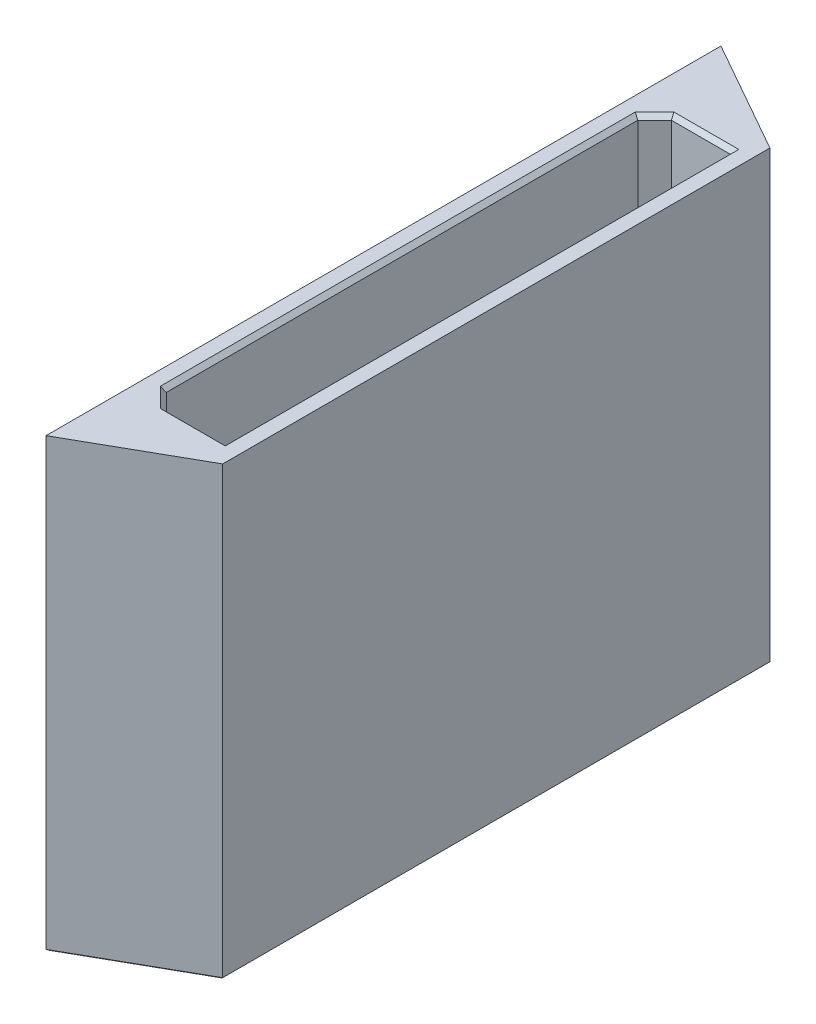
ISO-10303-21;
HEADER;
FILE_DESCRIPTION(('STEP AP214'),'2;1');
FILE_NAME('part.step','',(''),(''),'','','');
FILE_SCHEMA(('AUTOMOTIVE_DESIGN { 1 0 10303 214 1 1 1 1 }'));
ENDSEC;
DATA;
#1=APPLICATION_CONTEXT('core data for automotive mechanical design processes');
#2=APPLICATION_PROTOCOL_DEFINITION('international standard','automotive_design',2000,#1);
#3=PRODUCT_CONTEXT('',#1,'mechanical');
#4=PRODUCT('Part','Part','',(#3));
#5=PRODUCT_RELATED_PRODUCT_CATEGORY('part','',(#4));
#6=PRODUCT_DEFINITION_FORMATION('','',#4);
#7=PRODUCT_DEFINITION_CONTEXT('part definition',#1,'design');
#8=PRODUCT_DEFINITION('design','',#6,#7);
#9=PRODUCT_DEFINITION_SHAPE('','',#8);
#10=(LENGTH_UNIT() NAMED_UNIT(*) SI_UNIT(.MILLI.,.METRE.));
#11=(NAMED_UNIT(*) PLANE_ANGLE_UNIT() SI_UNIT($,.RADIAN.));
#12=(NAMED_UNIT(*) SI_UNIT($,.STERADIAN.) SOLID_ANGLE_UNIT());
#13=UNCERTAINTY_MEASURE_WITH_UNIT(LENGTH_MEASURE(1.E-05),#10,'distance_accuracy_value','');
#14=(GEOMETRIC_REPRESENTATION_CONTEXT(3) GLOBAL_UNCERTAINTY_ASSIGNED_CONTEXT((#13)) GLOBAL_UNIT_ASSIGNED_CONTEXT((#10,
#11,#12)) REPRESENTATION_CONTEXT('',''));
#15=CARTESIAN_POINT('',(0.,0.,0.));
#16=DIRECTION('',(0.,0.,1.));
#17=DIRECTION('',(1.,0.,0.));
#18=AXIS2_PLACEMENT_3D('',#15,#16,#17);
#19=CARTESIAN_POINT('',(6.92211151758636,13.5,-97.1627104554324));
#20=DIRECTION('',(-1.,0.,0.));
#21=DIRECTION('',(0.,0.,1.));
#22=AXIS2_PLACEMENT_3D('',#19,#20,#21);
#23=PLANE('',#22);
#24=CARTESIAN_POINT('',(6.92211151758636,17.5,-95.1627104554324));
#25=DIRECTION('',(-1.,0.,0.));
#26=DIRECTION('',(0.,0.,1.));
#27=AXIS2_PLACEMENT_3D('',#24,#25,#26);
#28=CIRCLE('',#27,0.499999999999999);
#29=CARTESIAN_POINT('',(6.92211151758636,17.5,-94.6627104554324));
#30=VERTEX_POINT('',#29);
#31=EDGE_CURVE('E524',#30,#30,#28,.T.);
#32=ORIENTED_EDGE('',*,*,#31,.T.);
#33=EDGE_LOOP('',(#32));
#34=FACE_BOUND('',#33,.T.);
#35=DIRECTION('',(0.,0.,1.));
#36=VECTOR('',#35,1.);
#37=CARTESIAN_POINT('',(6.92211151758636,23.2,-97.1627104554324));
#38=LINE('',#37,#36);
#39=CARTESIAN_POINT('',(6.92211151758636,23.2,-97.1627104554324));
#40=VERTEX_POINT('',#39);
#41=CARTESIAN_POINT('',(6.92211151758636,23.2,-83.5627104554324));
#42=VERTEX_POINT('',#41);
#43=EDGE_CURVE('E560',#40,#42,#38,.T.);
#44=ORIENTED_EDGE('',*,*,#43,.T.);
#45=DIRECTION('',(0.,-0.707106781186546,-0.707106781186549));
#46=VECTOR('',#45,1.);
#47=CARTESIAN_POINT('',(6.92211151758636,11.55,-95.2127104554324));
#48=LINE('',#47,#46);
#49=CARTESIAN_POINT('',(6.92211151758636,13.5,-93.2627104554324));
#50=VERTEX_POINT('',#49);
#51=EDGE_CURVE('E986',#42,#50,#48,.T.);
#52=ORIENTED_EDGE('',*,*,#51,.T.);
#53=DIRECTION('',(0.,0.,1.));
#54=VECTOR('',#53,1.);
#55=CARTESIAN_POINT('',(6.92211151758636,13.5,-97.1627104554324));
#56=LINE('',#55,#54);
#57=CARTESIAN_POINT('',(6.92211151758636,13.5,-97.1627104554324));
#58=VERTEX_POINT('',#57);
#59=EDGE_CURVE('E712',#58,#50,#56,.T.);
#60=ORIENTED_EDGE('',*,*,#59,.F.);
#61=DIRECTION('',(0.,1.,0.));
#62=VECTOR('',#61,1.);
#63=CARTESIAN_POINT('',(6.92211151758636,13.5,-97.1627104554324));
#64=LINE('',#63,#62);
#65=EDGE_CURVE('E725',#58,#40,#64,.T.);
#66=ORIENTED_EDGE('',*,*,#65,.T.);
#67=EDGE_LOOP('',(#44,#52,#60,#66));
#68=FACE_BOUND('',#67,.T.);
#69=ADVANCED_FACE('F36',(#34,#68),#23,.F.);
#70=CARTESIAN_POINT('',(6.92211151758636,23.2,-97.1627104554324));
#71=DIRECTION('',(-0.707106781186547,-0.707106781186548,0.));
#72=DIRECTION('',(0.,0.,1.));
#73=AXIS2_PLACEMENT_3D('',#70,#71,#72);
#74=PLANE('',#73);
#75=DIRECTION('',(0.577350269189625,-0.577350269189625,-0.577350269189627));
#76=VECTOR('',#75,1.);
#77=CARTESIAN_POINT('',(11.4554448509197,18.6666666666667,-88.0960437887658));
#78=LINE('',#77,#76);
#79=CARTESIAN_POINT('',(5.92211151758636,24.2,-82.5627104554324));
#80=VERTEX_POINT('',#79);
#81=EDGE_CURVE('E596',#42,#80,#78,.F.);
#82=ORIENTED_EDGE('',*,*,#81,.F.);
#83=ORIENTED_EDGE('',*,*,#43,.F.);
#84=DIRECTION('',(-0.577350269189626,0.577350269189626,-0.577350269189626));
#85=VECTOR('',#84,1.);
#86=CARTESIAN_POINT('',(6.92211151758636,23.2,-97.1627104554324));
#87=LINE('',#86,#85);
#88=CARTESIAN_POINT('',(5.92211151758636,24.2,-98.1627104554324));
#89=VERTEX_POINT('',#88);
#90=EDGE_CURVE('E568',#89,#40,#87,.F.);
#91=ORIENTED_EDGE('',*,*,#90,.F.);
#92=DIRECTION('',(0.,0.,-1.));
#93=VECTOR('',#92,1.);
#94=CARTESIAN_POINT('',(5.92211151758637,24.2,0.));
#95=LINE('',#94,#93);
#96=EDGE_CURVE('E544',#80,#89,#95,.T.);
#97=ORIENTED_EDGE('',*,*,#96,.F.);
#98=EDGE_LOOP('',(#82,#83,#91,#97));
#99=FACE_BOUND('',#98,.T.);
#100=ADVANCED_FACE('F806',(#99),#74,.F.);
#101=CARTESIAN_POINT('',(0.,13.5,0.));
#102=DIRECTION('',(0.,1.,0.));
#103=DIRECTION('',(0.,0.,1.));
#104=AXIS2_PLACEMENT_3D('',#101,#102,#103);
#105=PLANE('',#104);
#106=DIRECTION('',(0.,0.,-1.));
#107=VECTOR('',#106,1.);
#108=CARTESIAN_POINT('',(14.0221115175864,13.5,-97.1627104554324));
#109=LINE('',#108,#107);
#110=CARTESIAN_POINT('',(14.0221115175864,13.5,-53.5627104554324));
#111=VERTEX_POINT('',#110);
#112=CARTESIAN_POINT('',(14.0221115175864,13.5,-61.2127104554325));
#113=VERTEX_POINT('',#112);
#114=EDGE_CURVE('E719',#111,#113,#109,.T.);
#115=ORIENTED_EDGE('',*,*,#114,.T.);
#116=DIRECTION('',(1.,0.,0.));
#117=VECTOR('',#116,1.);
#118=CARTESIAN_POINT('',(13.,13.5,-61.2127104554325));
#119=LINE('',#118,#117);
#120=CARTESIAN_POINT('',(13.,13.5,-61.2127104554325));
#121=VERTEX_POINT('',#120);
#122=EDGE_CURVE('E860',#121,#113,#119,.T.);
#123=ORIENTED_EDGE('',*,*,#122,.F.);
#124=DIRECTION('',(0.,0.,-1.));
#125=VECTOR('',#124,1.);
#126=CARTESIAN_POINT('',(13.,13.5,-93.2627104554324));
#127=LINE('',#126,#125);
#128=CARTESIAN_POINT('',(13.,13.5,-58.2127104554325));
#129=VERTEX_POINT('',#128);
#130=EDGE_CURVE('E701',#129,#121,#127,.T.);
#131=ORIENTED_EDGE('',*,*,#130,.F.);
#132=DIRECTION('',(-1.,0.,0.));
#133=VECTOR('',#132,1.);
#134=CARTESIAN_POINT('',(13.,13.5,-58.2127104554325));
#135=LINE('',#134,#133);
#136=CARTESIAN_POINT('',(6.92211151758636,13.5,-58.2127104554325));
#137=VERTEX_POINT('',#136);
#138=EDGE_CURVE('E364',#129,#137,#135,.T.);
#139=ORIENTED_EDGE('',*,*,#138,.T.);
#140=CARTESIAN_POINT('',(6.92211151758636,13.5,-53.5627104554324));
#141=VERTEX_POINT('',#140);
#142=EDGE_CURVE('E707',#137,#141,#56,.T.);
#143=ORIENTED_EDGE('',*,*,#142,.T.);
#144=DIRECTION('',(1.,0.,0.));
#145=VECTOR('',#144,1.);
#146=CARTESIAN_POINT('',(6.92211151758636,13.5,-53.5627104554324));
#147=LINE('',#146,#145);
#148=EDGE_CURVE('E715',#141,#111,#147,.T.);
#149=ORIENTED_EDGE('',*,*,#148,.T.);
#150=EDGE_LOOP('',(#115,#123,#131,#139,#143,#149));
#151=FACE_BOUND('',#150,.T.);
#152=ADVANCED_FACE('F813',(#151),#105,.T.);
#153=CARTESIAN_POINT('',(13.,0.,0.));
#154=DIRECTION('',(1.,0.,0.));
#155=DIRECTION('',(0.,0.,-1.));
#156=AXIS2_PLACEMENT_3D('',#153,#154,#155);
#157=PLANE('',#156);
#158=ORIENTED_EDGE('',*,*,#130,.T.);
#159=DIRECTION('',(0.,1.,0.));
#160=VECTOR('',#159,1.);
#161=CARTESIAN_POINT('',(13.,-26.0679757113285,-61.2127104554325));
#162=LINE('',#161,#160);
#163=CARTESIAN_POINT('',(13.,3.,-61.2127104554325));
#164=VERTEX_POINT('',#163);
#165=EDGE_CURVE('E847',#164,#121,#162,.T.);
#166=ORIENTED_EDGE('',*,*,#165,.F.);
#167=DIRECTION('',(0.,0.,1.));
#168=VECTOR('',#167,1.);
#169=CARTESIAN_POINT('',(13.,3.,-93.2627104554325));
#170=LINE('',#169,#168);
#171=CARTESIAN_POINT('',(13.,3.,-58.2127104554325));
#172=VERTEX_POINT('',#171);
#173=EDGE_CURVE('E695',#164,#172,#170,.T.);
#174=ORIENTED_EDGE('',*,*,#173,.T.);
#175=DIRECTION('',(0.,1.,0.));
#176=VECTOR('',#175,1.);
#177=CARTESIAN_POINT('',(13.,3.,-58.2127104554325));
#178=LINE('',#177,#176);
#179=EDGE_CURVE('E674',#172,#129,#178,.T.);
#180=ORIENTED_EDGE('',*,*,#179,.T.);
#181=EDGE_LOOP('',(#158,#166,#174,#180));
#182=FACE_BOUND('',#181,.T.);
#183=ADVANCED_FACE('F845',(#182),#157,.F.);
#184=DIRECTION('',(-1.,0.,0.));
#185=VECTOR('',#184,1.);
#186=CARTESIAN_POINT('',(13.,13.5,-93.2627104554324));
#187=LINE('',#186,#185);
#188=CARTESIAN_POINT('',(13.,13.5,-93.2627104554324));
#189=VERTEX_POINT('',#188);
#190=EDGE_CURVE('E705',#189,#50,#187,.T.);
#191=ORIENTED_EDGE('',*,*,#190,.F.);
#192=CARTESIAN_POINT('',(13.,13.5,-90.2627104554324));
#193=VERTEX_POINT('',#192);
#194=EDGE_CURVE('E700',#193,#189,#127,.T.);
#195=ORIENTED_EDGE('',*,*,#194,.F.);
#196=DIRECTION('',(-1.,0.,0.));
#197=VECTOR('',#196,1.);
#198=CARTESIAN_POINT('',(13.,13.5,-90.2627104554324));
#199=LINE('',#198,#197);
#200=CARTESIAN_POINT('',(14.0221115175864,13.5,-90.2627104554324));
#201=VERTEX_POINT('',#200);
#202=EDGE_CURVE('E856',#201,#193,#199,.T.);
#203=ORIENTED_EDGE('',*,*,#202,.F.);
#204=CARTESIAN_POINT('',(14.0221115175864,13.5,-97.1627104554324));
#205=VERTEX_POINT('',#204);
#206=EDGE_CURVE('E718',#201,#205,#109,.T.);
#207=ORIENTED_EDGE('',*,*,#206,.T.);
#208=DIRECTION('',(-1.,0.,0.));
#209=VECTOR('',#208,1.);
#210=CARTESIAN_POINT('',(6.92211151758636,13.5,-97.1627104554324));
#211=LINE('',#210,#209);
#212=EDGE_CURVE('E721',#205,#58,#211,.T.);
#213=ORIENTED_EDGE('',*,*,#212,.T.);
#214=ORIENTED_EDGE('',*,*,#59,.T.);
#215=EDGE_LOOP('',(#191,#195,#203,#207,#213,#214));
#216=FACE_BOUND('',#215,.T.);
#217=ADVANCED_FACE('F947',(#216),#105,.T.);
#218=CARTESIAN_POINT('',(26.8,106.,-15.1627104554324));
#219=DIRECTION('',(-0.492423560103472,0.,-0.870355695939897));
#220=DIRECTION('',(-0.870355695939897,0.,0.492423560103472));
#221=AXIS2_PLACEMENT_3D('',#218,#219,#220);
#222=PLANE('',#221);
#223=DIRECTION('',(0.,-1.,0.));
#224=VECTOR('',#223,1.);
#225=CARTESIAN_POINT('',(0.,106.,0.));
#226=LINE('',#225,#224);
#227=CARTESIAN_POINT('',(0.,106.,0.));
#228=VERTEX_POINT('',#227);
#229=CARTESIAN_POINT('',(0.,0.299999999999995,0.));
#230=VERTEX_POINT('',#229);
#231=EDGE_CURVE('E651',#228,#230,#226,.T.);
#232=ORIENTED_EDGE('',*,*,#231,.T.);
#233=DIRECTION('',(0.870355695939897,0.,-0.492423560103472));
#234=VECTOR('',#233,1.);
#235=CARTESIAN_POINT('',(26.8,0.299999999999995,-15.1627104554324));
#236=LINE('',#235,#234);
#237=CARTESIAN_POINT('',(26.8,0.299999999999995,-15.1627104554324));
#238=VERTEX_POINT('',#237);
#239=EDGE_CURVE('E13',#230,#238,#236,.T.);
#240=ORIENTED_EDGE('',*,*,#239,.T.);
#241=DIRECTION('',(0.,-1.,0.));
#242=VECTOR('',#241,1.);
#243=CARTESIAN_POINT('',(26.8,106.,-15.1627104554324));
#244=LINE('',#243,#242);
#245=CARTESIAN_POINT('',(26.8,106.,-15.1627104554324));
#246=VERTEX_POINT('',#245);
#247=EDGE_CURVE('E644',#246,#238,#244,.T.);
#248=ORIENTED_EDGE('',*,*,#247,.F.);
#249=DIRECTION('',(0.870355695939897,0.,-0.492423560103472));
#250=VECTOR('',#249,1.);
#251=CARTESIAN_POINT('',(26.8,106.,-15.1627104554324));
#252=LINE('',#251,#250);
#253=EDGE_CURVE('E780',#228,#246,#252,.T.);
#254=ORIENTED_EDGE('',*,*,#253,.F.);
#255=EDGE_LOOP('',(#232,#240,#248,#254));
#256=FACE_BOUND('',#255,.T.);
#257=ADVANCED_FACE('F789',(#256),#222,.F.);
#258=CARTESIAN_POINT('',(26.8,106.,-145.162710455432));
#259=DIRECTION('',(-1.,0.,0.));
#260=DIRECTION('',(0.,0.,1.));
#261=AXIS2_PLACEMENT_3D('',#258,#259,#260);
#262=PLANE('',#261);
#263=ORIENTED_EDGE('',*,*,#247,.T.);
#264=DIRECTION('',(0.,0.,-1.));
#265=VECTOR('',#264,1.);
#266=CARTESIAN_POINT('',(26.8,0.299999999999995,-145.162710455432));
#267=LINE('',#266,#265);
#268=CARTESIAN_POINT('',(26.8,0.299999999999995,-145.162710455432));
#269=VERTEX_POINT('',#268);
#270=EDGE_CURVE('E598',#238,#269,#267,.T.);
#271=ORIENTED_EDGE('',*,*,#270,.T.);
#272=DIRECTION('',(0.,-1.,0.));
#273=VECTOR('',#272,1.);
#274=CARTESIAN_POINT('',(26.8,106.,-145.162710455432));
#275=LINE('',#274,#273);
#276=CARTESIAN_POINT('',(26.8,106.,-145.162710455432));
#277=VERTEX_POINT('',#276);
#278=EDGE_CURVE('E641',#277,#269,#275,.T.);
#279=ORIENTED_EDGE('',*,*,#278,.F.);
#280=DIRECTION('',(0.,0.,-1.));
#281=VECTOR('',#280,1.);
#282=CARTESIAN_POINT('',(26.8,106.,-145.162710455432));
#283=LINE('',#282,#281);
#284=EDGE_CURVE('E783',#246,#277,#283,.T.);
#285=ORIENTED_EDGE('',*,*,#284,.F.);
#286=EDGE_LOOP('',(#263,#271,#279,#285));
#287=FACE_BOUND('',#286,.T.);
#288=ADVANCED_FACE('F640',(#287),#262,.F.);
#289=CARTESIAN_POINT('',(0.,106.,-160.325420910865));
#290=DIRECTION('',(-0.492423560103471,0.,0.870355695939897));
#291=DIRECTION('',(0.870355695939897,0.,0.492423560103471));
#292=AXIS2_PLACEMENT_3D('',#289,#290,#291);
#293=PLANE('',#292);
#294=ORIENTED_EDGE('',*,*,#278,.T.);
#295=DIRECTION('',(-0.870355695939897,0.,-0.492423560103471));
#296=VECTOR('',#295,1.);
#297=CARTESIAN_POINT('',(0.,0.299999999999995,-160.325420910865));
#298=LINE('',#297,#296);
#299=CARTESIAN_POINT('',(0.,0.299999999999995,-160.325420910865));
#300=VERTEX_POINT('',#299);
#301=EDGE_CURVE('E60',#269,#300,#298,.T.);
#302=ORIENTED_EDGE('',*,*,#301,.T.);
#303=DIRECTION('',(0.,-1.,0.));
#304=VECTOR('',#303,1.);
#305=CARTESIAN_POINT('',(0.,106.,-160.325420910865));
#306=LINE('',#305,#304);
#307=CARTESIAN_POINT('',(0.,106.,-160.325420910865));
#308=VERTEX_POINT('',#307);
#309=EDGE_CURVE('E647',#308,#300,#306,.T.);
#310=ORIENTED_EDGE('',*,*,#309,.F.);
#311=DIRECTION('',(-0.870355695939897,0.,-0.492423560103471));
#312=VECTOR('',#311,1.);
#313=CARTESIAN_POINT('',(0.,106.,-160.325420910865));
#314=LINE('',#313,#312);
#315=EDGE_CURVE('E646',#277,#308,#314,.T.);
#316=ORIENTED_EDGE('',*,*,#315,.F.);
#317=EDGE_LOOP('',(#294,#302,#310,#316));
#318=FACE_BOUND('',#317,.T.);
#319=ADVANCED_FACE('F645',(#318),#293,.F.);
#320=CARTESIAN_POINT('',(0.,106.,0.));
#321=DIRECTION('',(1.,0.,0.));
#322=DIRECTION('',(0.,0.,-1.));
#323=AXIS2_PLACEMENT_3D('',#320,#321,#322);
#324=PLANE('',#323);
#325=CARTESIAN_POINT('',(0.,17.5,-55.5627104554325));
#326=DIRECTION('',(1.,0.,0.));
#327=DIRECTION('',(0.,0.,-1.));
#328=AXIS2_PLACEMENT_3D('',#325,#326,#327);
#329=CIRCLE('',#328,1.00000000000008);
#330=CARTESIAN_POINT('',(0.,17.5,-56.5627104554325));
#331=VERTEX_POINT('',#330);
#332=EDGE_CURVE('E536',#331,#331,#329,.T.);
#333=ORIENTED_EDGE('',*,*,#332,.T.);
#334=EDGE_LOOP('',(#333));
#335=FACE_BOUND('',#334,.T.);
#336=CARTESIAN_POINT('',(0.,17.5,-95.1627104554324));
#337=DIRECTION('',(1.,0.,0.));
#338=DIRECTION('',(0.,0.,-1.));
#339=AXIS2_PLACEMENT_3D('',#336,#337,#338);
#340=CIRCLE('',#339,1.00000000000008);
#341=CARTESIAN_POINT('',(0.,17.5,-96.1627104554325));
#342=VERTEX_POINT('',#341);
#343=EDGE_CURVE('E533',#342,#342,#340,.T.);
#344=ORIENTED_EDGE('',*,*,#343,.T.);
#345=EDGE_LOOP('',(#344));
#346=FACE_BOUND('',#345,.T.);
#347=CARTESIAN_POINT('',(0.,86.,-9.99999999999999));
#348=DIRECTION('',(1.,0.,0.));
#349=DIRECTION('',(0.,0.,-1.));
#350=AXIS2_PLACEMENT_3D('',#347,#348,#349);
#351=CIRCLE('',#350,1.60000000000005);
#352=CARTESIAN_POINT('',(0.,86.,-8.39999999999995));
#353=VERTEX_POINT('',#352);
#354=EDGE_CURVE('E502',#353,#353,#351,.T.);
#355=ORIENTED_EDGE('',*,*,#354,.T.);
#356=EDGE_LOOP('',(#355));
#357=FACE_BOUND('',#356,.T.);
#358=CARTESIAN_POINT('',(0.,71.,-150.325420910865));
#359=DIRECTION('',(1.,0.,0.));
#360=DIRECTION('',(0.,0.,-1.));
#361=AXIS2_PLACEMENT_3D('',#358,#359,#360);
#362=CIRCLE('',#361,1.59999999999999);
#363=CARTESIAN_POINT('',(0.,71.,-151.925420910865));
#364=VERTEX_POINT('',#363);
#365=EDGE_CURVE('E499',#364,#364,#362,.T.);
#366=ORIENTED_EDGE('',*,*,#365,.T.);
#367=EDGE_LOOP('',(#366));
#368=FACE_BOUND('',#367,.T.);
#369=CARTESIAN_POINT('',(0.,96.,-10.));
#370=DIRECTION('',(1.,0.,0.));
#371=DIRECTION('',(0.,0.,-1.));
#372=AXIS2_PLACEMENT_3D('',#369,#370,#371);
#373=CIRCLE('',#372,1.59999999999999);
#374=CARTESIAN_POINT('',(0.,96.,-11.6));
#375=VERTEX_POINT('',#374);
#376=EDGE_CURVE('E496',#375,#375,#373,.T.);
#377=ORIENTED_EDGE('',*,*,#376,.T.);
#378=EDGE_LOOP('',(#377));
#379=FACE_BOUND('',#378,.T.);
#380=CARTESIAN_POINT('',(0.,23.5,-9.99999999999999));
#381=DIRECTION('',(1.,0.,0.));
#382=DIRECTION('',(0.,0.,-1.));
#383=AXIS2_PLACEMENT_3D('',#380,#381,#382);
#384=CIRCLE('',#383,1.60000000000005);
#385=CARTESIAN_POINT('',(0.,23.5,-11.6));
#386=VERTEX_POINT('',#385);
#387=EDGE_CURVE('E493',#386,#386,#384,.T.);
#388=ORIENTED_EDGE('',*,*,#387,.T.);
#389=EDGE_LOOP('',(#388));
#390=FACE_BOUND('',#389,.T.);
#391=CARTESIAN_POINT('',(0.,96.,-150.325420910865));
#392=DIRECTION('',(1.,0.,0.));
#393=DIRECTION('',(0.,0.,-1.));
#394=AXIS2_PLACEMENT_3D('',#391,#392,#393);
#395=CIRCLE('',#394,1.59999999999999);
#396=CARTESIAN_POINT('',(0.,96.,-151.925420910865));
#397=VERTEX_POINT('',#396);
#398=EDGE_CURVE('E490',#397,#397,#395,.T.);
#399=ORIENTED_EDGE('',*,*,#398,.T.);
#400=EDGE_LOOP('',(#399));
#401=FACE_BOUND('',#400,.T.);
#402=CARTESIAN_POINT('',(0.,23.5,-150.325420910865));
#403=DIRECTION('',(1.,0.,0.));
#404=DIRECTION('',(0.,0.,-1.));
#405=AXIS2_PLACEMENT_3D('',#402,#403,#404);
#406=CIRCLE('',#405,1.59999999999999);
#407=CARTESIAN_POINT('',(0.,23.5,-151.925420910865));
#408=VERTEX_POINT('',#407);
#409=EDGE_CURVE('E487',#408,#408,#406,.T.);
#410=ORIENTED_EDGE('',*,*,#409,.T.);
#411=EDGE_LOOP('',(#410));
#412=FACE_BOUND('',#411,.T.);
#413=DIRECTION('',(0.,-1.,0.));
#414=VECTOR('',#413,1.);
#415=CARTESIAN_POINT('',(0.,3.,-93.2627104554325));
#416=LINE('',#415,#414);
#417=CARTESIAN_POINT('',(0.,13.5,-93.2627104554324));
#418=VERTEX_POINT('',#417);
#419=CARTESIAN_POINT('',(0.,3.,-93.2627104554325));
#420=VERTEX_POINT('',#419);
#421=EDGE_CURVE('E683',#418,#420,#416,.T.);
#422=ORIENTED_EDGE('',*,*,#421,.F.);
#423=DIRECTION('',(0.,-0.707106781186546,-0.707106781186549));
#424=VECTOR('',#423,1.);
#425=CARTESIAN_POINT('',(0.,31.0249999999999,-75.7377104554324));
#426=LINE('',#425,#424);
#427=CARTESIAN_POINT('',(0.,31.0249999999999,-75.7377104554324));
#428=VERTEX_POINT('',#427);
#429=EDGE_CURVE('E375',#428,#418,#426,.T.);
#430=ORIENTED_EDGE('',*,*,#429,.F.);
#431=DIRECTION('',(0.,0.707106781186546,-0.707106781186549));
#432=VECTOR('',#431,1.);
#433=CARTESIAN_POINT('',(0.,31.0249999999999,-75.7377104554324));
#434=LINE('',#433,#432);
#435=CARTESIAN_POINT('',(0.,13.5,-58.2127104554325));
#436=VERTEX_POINT('',#435);
#437=EDGE_CURVE('E357',#436,#428,#434,.T.);
#438=ORIENTED_EDGE('',*,*,#437,.F.);
#439=DIRECTION('',(0.,0.,1.));
#440=VECTOR('',#439,1.);
#441=CARTESIAN_POINT('',(0.,13.5,0.));
#442=LINE('',#441,#440);
#443=CARTESIAN_POINT('',(0.,13.5,-30.));
#444=VERTEX_POINT('',#443);
#445=EDGE_CURVE('E374',#436,#444,#442,.T.);
#446=ORIENTED_EDGE('',*,*,#445,.T.);
#447=DIRECTION('',(0.,-1.,0.));
#448=VECTOR('',#447,1.);
#449=CARTESIAN_POINT('',(0.,81.,-30.));
#450=LINE('',#449,#448);
#451=CARTESIAN_POINT('',(0.,80.5999999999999,-30.));
#452=VERTEX_POINT('',#451);
#453=EDGE_CURVE('E884',#452,#444,#450,.T.);
#454=ORIENTED_EDGE('',*,*,#453,.F.);
#455=DIRECTION('',(0.,0.,1.));
#456=VECTOR('',#455,1.);
#457=CARTESIAN_POINT('',(0.,80.6,0.));
#458=LINE('',#457,#456);
#459=CARTESIAN_POINT('',(0.,80.6,-5.40000000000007));
#460=VERTEX_POINT('',#459);
#461=EDGE_CURVE('E582',#452,#460,#458,.T.);
#462=ORIENTED_EDGE('',*,*,#461,.T.);
#463=DIRECTION('',(0.,-1.,0.));
#464=VECTOR('',#463,1.);
#465=CARTESIAN_POINT('',(0.,106.,-5.40000000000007));
#466=LINE('',#465,#464);
#467=CARTESIAN_POINT('',(0.,28.5,-5.40000000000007));
#468=VERTEX_POINT('',#467);
#469=EDGE_CURVE('E592',#460,#468,#466,.T.);
#470=ORIENTED_EDGE('',*,*,#469,.T.);
#471=DIRECTION('',(0.,0.,1.));
#472=VECTOR('',#471,1.);
#473=CARTESIAN_POINT('',(0.,28.5,-15.));
#474=LINE('',#473,#472);
#475=CARTESIAN_POINT('',(0.,28.5,-15.));
#476=VERTEX_POINT('',#475);
#477=EDGE_CURVE('E881',#476,#468,#474,.T.);
#478=ORIENTED_EDGE('',*,*,#477,.F.);
#479=DIRECTION('',(0.,1.,0.));
#480=VECTOR('',#479,1.);
#481=CARTESIAN_POINT('',(0.,3.,-15.));
#482=LINE('',#481,#480);
#483=CARTESIAN_POINT('',(0.,13.5,-15.));
#484=VERTEX_POINT('',#483);
#485=EDGE_CURVE('E873',#484,#476,#482,.T.);
#486=ORIENTED_EDGE('',*,*,#485,.F.);
#487=CARTESIAN_POINT('',(0.,13.5,-4.99999999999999));
#488=VERTEX_POINT('',#487);
#489=EDGE_CURVE('E402',#484,#488,#442,.T.);
#490=ORIENTED_EDGE('',*,*,#489,.T.);
#491=DIRECTION('',(0.,1.,0.));
#492=VECTOR('',#491,1.);
#493=CARTESIAN_POINT('',(0.,10.,-5.));
#494=LINE('',#493,#492);
#495=CARTESIAN_POINT('',(0.,3.,-5.));
#496=VERTEX_POINT('',#495);
#497=EDGE_CURVE('E484',#496,#488,#494,.T.);
#498=ORIENTED_EDGE('',*,*,#497,.F.);
#499=DIRECTION('',(0.,0.,1.));
#500=VECTOR('',#499,1.);
#501=CARTESIAN_POINT('',(0.,3.,-93.2627104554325));
#502=LINE('',#501,#500);
#503=EDGE_CURVE('E685',#420,#496,#502,.T.);
#504=ORIENTED_EDGE('',*,*,#503,.F.);
#505=EDGE_LOOP('',(#422,#430,#438,#446,#454,#462,#470,#478,#486,#490,#498,#504));
#506=FACE_BOUND('',#505,.T.);
#507=ORIENTED_EDGE('',*,*,#309,.T.);
#508=DIRECTION('',(0.,0.,1.));
#509=VECTOR('',#508,1.);
#510=CARTESIAN_POINT('',(0.,0.299999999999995,0.));
#511=LINE('',#510,#509);
#512=EDGE_CURVE('E45',#300,#230,#511,.T.);
#513=ORIENTED_EDGE('',*,*,#512,.T.);
#514=ORIENTED_EDGE('',*,*,#231,.F.);
#515=DIRECTION('',(0.,0.,1.));
#516=VECTOR('',#515,1.);
#517=CARTESIAN_POINT('',(0.,106.,0.));
#518=LINE('',#517,#516);
#519=EDGE_CURVE('E786',#308,#228,#518,.T.);
#520=ORIENTED_EDGE('',*,*,#519,.F.);
#521=EDGE_LOOP('',(#507,#513,#514,#520));
#522=FACE_BOUND('',#521,.T.);
#523=ADVANCED_FACE('F371',(#335,#346,#357,#368,#379,#390,#401,#412,#506,#522),#324,.F.);
#524=CARTESIAN_POINT('',(0.,106.,0.));
#525=DIRECTION('',(0.,-1.,0.));
#526=DIRECTION('',(0.,0.,-1.));
#527=AXIS2_PLACEMENT_3D('',#524,#525,#526);
#528=PLANE('',#527);
#529=DIRECTION('',(0.707106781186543,0.,-0.707106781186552));
#530=VECTOR('',#529,1.);
#531=CARTESIAN_POINT('',(-66.5884620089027,106.,-66.5884620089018));
#532=LINE('',#531,#530);
#533=CARTESIAN_POINT('',(3.40000000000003,106.,-136.576924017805));
#534=VERTEX_POINT('',#533);
#535=CARTESIAN_POINT('',(7.98578643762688,106.,-141.162710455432));
#536=VERTEX_POINT('',#535);
#537=EDGE_CURVE('E451',#534,#536,#532,.T.);
#538=ORIENTED_EDGE('',*,*,#537,.T.);
#539=DIRECTION('',(1.,0.,0.));
#540=VECTOR('',#539,1.);
#541=CARTESIAN_POINT('',(0.,106.,-141.162710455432));
#542=LINE('',#541,#540);
#543=CARTESIAN_POINT('',(23.4,106.,-141.162710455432));
#544=VERTEX_POINT('',#543);
#545=EDGE_CURVE('E453',#536,#544,#542,.T.);
#546=ORIENTED_EDGE('',*,*,#545,.T.);
#547=DIRECTION('',(0.,0.,1.));
#548=VECTOR('',#547,1.);
#549=CARTESIAN_POINT('',(23.4,106.,0.));
#550=LINE('',#549,#548);
#551=CARTESIAN_POINT('',(23.4,106.,-19.1627104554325));
#552=VERTEX_POINT('',#551);
#553=EDGE_CURVE('E443',#544,#552,#550,.T.);
#554=ORIENTED_EDGE('',*,*,#553,.T.);
#555=DIRECTION('',(-1.,0.,0.));
#556=VECTOR('',#555,1.);
#557=CARTESIAN_POINT('',(0.,106.,-19.1627104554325));
#558=LINE('',#557,#556);
#559=CARTESIAN_POINT('',(7.98578643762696,106.,-19.1627104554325));
#560=VERTEX_POINT('',#559);
#561=EDGE_CURVE('E445',#552,#560,#558,.T.);
#562=ORIENTED_EDGE('',*,*,#561,.T.);
#563=DIRECTION('',(-0.707106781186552,0.,-0.707106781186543));
#564=VECTOR('',#563,1.);
#565=CARTESIAN_POINT('',(13.5742484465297,106.,-13.5742484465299));
#566=LINE('',#565,#564);
#567=CARTESIAN_POINT('',(3.40000000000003,106.,-23.7484968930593));
#568=VERTEX_POINT('',#567);
#569=EDGE_CURVE('E447',#560,#568,#566,.T.);
#570=ORIENTED_EDGE('',*,*,#569,.T.);
#571=DIRECTION('',(0.,0.,-1.));
#572=VECTOR('',#571,1.);
#573=CARTESIAN_POINT('',(3.40000000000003,106.,0.));
#574=LINE('',#573,#572);
#575=EDGE_CURVE('E449',#568,#534,#574,.T.);
#576=ORIENTED_EDGE('',*,*,#575,.T.);
#577=EDGE_LOOP('',(#538,#546,#554,#562,#570,#576));
#578=FACE_BOUND('',#577,.T.);
#579=ORIENTED_EDGE('',*,*,#253,.T.);
#580=ORIENTED_EDGE('',*,*,#284,.T.);
#581=ORIENTED_EDGE('',*,*,#315,.T.);
#582=ORIENTED_EDGE('',*,*,#519,.T.);
#583=EDGE_LOOP('',(#579,#580,#581,#582));
#584=FACE_BOUND('',#583,.T.);
#585=ADVANCED_FACE('F792',(#578,#584),#528,.F.);
#586=CARTESIAN_POINT('',(0.,0.,0.));
#587=DIRECTION('',(0.,-1.,0.));
#588=DIRECTION('',(0.,0.,-1.));
#589=AXIS2_PLACEMENT_3D('',#586,#587,#588);
#590=PLANE('',#589);
#591=DIRECTION('',(0.870355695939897,0.,0.492423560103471));
#592=VECTOR('',#591,1.);
#593=CARTESIAN_POINT('',(26.652272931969,0.,-144.90160374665));
#594=LINE('',#593,#592);
#595=CARTESIAN_POINT('',(0.299999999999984,0.,-159.811002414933));
#596=VERTEX_POINT('',#595);
#597=CARTESIAN_POINT('',(26.5,0.,-144.987755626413));
#598=VERTEX_POINT('',#597);
#599=EDGE_CURVE('E605',#596,#598,#594,.T.);
#600=ORIENTED_EDGE('',*,*,#599,.T.);
#601=DIRECTION('',(0.,0.,1.));
#602=VECTOR('',#601,1.);
#603=CARTESIAN_POINT('',(26.5,0.,-15.1627104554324));
#604=LINE('',#603,#602);
#605=CARTESIAN_POINT('',(26.5,0.,-15.3376652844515));
#606=VERTEX_POINT('',#605);
#607=EDGE_CURVE('E607',#598,#606,#604,.T.);
#608=ORIENTED_EDGE('',*,*,#607,.T.);
#609=DIRECTION('',(-0.870355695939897,0.,0.492423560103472));
#610=VECTOR('',#609,1.);
#611=CARTESIAN_POINT('',(-0.147727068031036,0.,-0.261106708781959));
#612=LINE('',#611,#610);
#613=CARTESIAN_POINT('',(0.299999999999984,0.,-0.514418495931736));
#614=VERTEX_POINT('',#613);
#615=EDGE_CURVE('E601',#606,#614,#612,.T.);
#616=ORIENTED_EDGE('',*,*,#615,.T.);
#617=DIRECTION('',(0.,0.,-1.));
#618=VECTOR('',#617,1.);
#619=CARTESIAN_POINT('',(0.299999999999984,0.,-160.325420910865));
#620=LINE('',#619,#618);
#621=EDGE_CURVE('E603',#614,#596,#620,.T.);
#622=ORIENTED_EDGE('',*,*,#621,.T.);
#623=EDGE_LOOP('',(#600,#608,#616,#622));
#624=FACE_BOUND('',#623,.T.);
#625=ADVANCED_FACE('F630',(#624),#590,.T.);
#626=CARTESIAN_POINT('',(0.,24.2,0.));
#627=DIRECTION('',(0.,-1.,0.));
#628=DIRECTION('',(0.,0.,-1.));
#629=AXIS2_PLACEMENT_3D('',#626,#627,#628);
#630=PLANE('',#629);
#631=DIRECTION('',(0.,0.,1.));
#632=VECTOR('',#631,1.);
#633=CARTESIAN_POINT('',(4.40000000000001,24.2,-27.1627104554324));
#634=LINE('',#633,#632);
#635=CARTESIAN_POINT('',(4.40000000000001,24.2,-133.162710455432));
#636=VERTEX_POINT('',#635);
#637=CARTESIAN_POINT('',(4.40000000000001,24.2,-82.5627104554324));
#638=VERTEX_POINT('',#637);
#639=EDGE_CURVE('E768',#636,#638,#634,.T.);
#640=ORIENTED_EDGE('',*,*,#639,.T.);
#641=DIRECTION('',(1.,0.,0.));
#642=VECTOR('',#641,1.);
#643=CARTESIAN_POINT('',(0.,24.2,-82.5627104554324));
#644=LINE('',#643,#642);
#645=EDGE_CURVE('E981',#638,#80,#644,.T.);
#646=ORIENTED_EDGE('',*,*,#645,.T.);
#647=ORIENTED_EDGE('',*,*,#96,.T.);
#648=DIRECTION('',(1.,0.,0.));
#649=VECTOR('',#648,1.);
#650=CARTESIAN_POINT('',(0.,24.2,-98.1627104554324));
#651=LINE('',#650,#649);
#652=CARTESIAN_POINT('',(15.0221115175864,24.2,-98.1627104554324));
#653=VERTEX_POINT('',#652);
#654=EDGE_CURVE('E550',#89,#653,#651,.T.);
#655=ORIENTED_EDGE('',*,*,#654,.T.);
#656=DIRECTION('',(0.,0.,1.));
#657=VECTOR('',#656,1.);
#658=CARTESIAN_POINT('',(15.0221115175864,24.2,0.));
#659=LINE('',#658,#657);
#660=CARTESIAN_POINT('',(15.0221115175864,24.2,-52.5627104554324));
#661=VERTEX_POINT('',#660);
#662=EDGE_CURVE('E552',#653,#661,#659,.T.);
#663=ORIENTED_EDGE('',*,*,#662,.T.);
#664=DIRECTION('',(-1.,0.,0.));
#665=VECTOR('',#664,1.);
#666=CARTESIAN_POINT('',(0.,24.2,-52.5627104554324));
#667=LINE('',#666,#665);
#668=CARTESIAN_POINT('',(5.92211151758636,24.2,-52.5627104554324));
#669=VERTEX_POINT('',#668);
#670=EDGE_CURVE('E548',#661,#669,#667,.T.);
#671=ORIENTED_EDGE('',*,*,#670,.T.);
#672=CARTESIAN_POINT('',(5.92211151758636,24.2,-68.9127104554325));
#673=VERTEX_POINT('',#672);
#674=EDGE_CURVE('E545',#669,#673,#95,.T.);
#675=ORIENTED_EDGE('',*,*,#674,.T.);
#676=DIRECTION('',(-1.,0.,0.));
#677=VECTOR('',#676,1.);
#678=CARTESIAN_POINT('',(0.,24.2,-68.9127104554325));
#679=LINE('',#678,#677);
#680=CARTESIAN_POINT('',(4.40000000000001,24.2,-68.9127104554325));
#681=VERTEX_POINT('',#680);
#682=EDGE_CURVE('E993',#673,#681,#679,.T.);
#683=ORIENTED_EDGE('',*,*,#682,.T.);
#684=CARTESIAN_POINT('',(4.40000000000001,24.2,-27.1627104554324));
#685=VERTEX_POINT('',#684);
#686=EDGE_CURVE('E771',#681,#685,#634,.T.);
#687=ORIENTED_EDGE('',*,*,#686,.T.);
#688=DIRECTION('',(1.,0.,0.));
#689=VECTOR('',#688,1.);
#690=CARTESIAN_POINT('',(4.40000000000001,24.2,-27.1627104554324));
#691=LINE('',#690,#689);
#692=CARTESIAN_POINT('',(22.4,24.2,-27.1627104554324));
#693=VERTEX_POINT('',#692);
#694=EDGE_CURVE('E764',#685,#693,#691,.T.);
#695=ORIENTED_EDGE('',*,*,#694,.T.);
#696=DIRECTION('',(0.,0.,-1.));
#697=VECTOR('',#696,1.);
#698=CARTESIAN_POINT('',(22.4,24.2,-27.1627104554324));
#699=LINE('',#698,#697);
#700=CARTESIAN_POINT('',(22.4,24.2,-133.162710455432));
#701=VERTEX_POINT('',#700);
#702=EDGE_CURVE('E759',#693,#701,#699,.T.);
#703=ORIENTED_EDGE('',*,*,#702,.T.);
#704=DIRECTION('',(-1.,0.,0.));
#705=VECTOR('',#704,1.);
#706=CARTESIAN_POINT('',(4.40000000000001,24.2,-133.162710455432));
#707=LINE('',#706,#705);
#708=EDGE_CURVE('E742',#701,#636,#707,.T.);
#709=ORIENTED_EDGE('',*,*,#708,.T.);
#710=EDGE_LOOP('',(#640,#646,#647,#655,#663,#671,#675,#683,#687,#695,#703,#709));
#711=FACE_BOUND('',#710,.T.);
#712=ADVANCED_FACE('F800',(#711),#630,.F.);
#713=CARTESIAN_POINT('',(4.40000000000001,-107.517440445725,-133.162710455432));
#714=DIRECTION('',(0.,0.,-1.));
#715=DIRECTION('',(-1.,0.,0.));
#716=AXIS2_PLACEMENT_3D('',#713,#714,#715);
#717=PLANE('',#716);
#718=DIRECTION('',(0.,1.,0.));
#719=VECTOR('',#718,1.);
#720=CARTESIAN_POINT('',(22.4,-107.517440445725,-133.162710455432));
#721=LINE('',#720,#719);
#722=CARTESIAN_POINT('',(22.4,47.2,-133.162710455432));
#723=VERTEX_POINT('',#722);
#724=EDGE_CURVE('E762',#701,#723,#721,.T.);
#725=ORIENTED_EDGE('',*,*,#724,.T.);
#726=DIRECTION('',(-1.,0.,0.));
#727=VECTOR('',#726,1.);
#728=CARTESIAN_POINT('',(4.40000000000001,47.2,-133.162710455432));
#729=LINE('',#728,#727);
#730=CARTESIAN_POINT('',(4.40000000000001,47.2,-133.162710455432));
#731=VERTEX_POINT('',#730);
#732=EDGE_CURVE('E422',#723,#731,#729,.T.);
#733=ORIENTED_EDGE('',*,*,#732,.T.);
#734=DIRECTION('',(0.,1.,0.));
#735=VECTOR('',#734,1.);
#736=CARTESIAN_POINT('',(4.40000000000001,-107.517440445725,-133.162710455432));
#737=LINE('',#736,#735);
#738=EDGE_CURVE('E758',#636,#731,#737,.T.);
#739=ORIENTED_EDGE('',*,*,#738,.F.);
#740=ORIENTED_EDGE('',*,*,#708,.F.);
#741=EDGE_LOOP('',(#725,#733,#739,#740));
#742=FACE_BOUND('',#741,.T.);
#743=ADVANCED_FACE('F1031',(#742),#717,.F.);
#744=CARTESIAN_POINT('',(4.40000000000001,-107.517440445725,-27.1627104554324));
#745=DIRECTION('',(-1.,0.,0.));
#746=DIRECTION('',(0.,0.,1.));
#747=AXIS2_PLACEMENT_3D('',#744,#745,#746);
#748=PLANE('',#747);
#749=DIRECTION('',(0.,0.707106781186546,-0.707106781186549));
#750=VECTOR('',#749,1.);
#751=CARTESIAN_POINT('',(4.40000000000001,-62.5337202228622,17.8210097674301));
#752=LINE('',#751,#750);
#753=CARTESIAN_POINT('',(4.40000000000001,31.0249999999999,-75.7377104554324));
#754=VERTEX_POINT('',#753);
#755=EDGE_CURVE('E991',#681,#754,#752,.T.);
#756=ORIENTED_EDGE('',*,*,#755,.T.);
#757=DIRECTION('',(0.,-0.707106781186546,-0.707106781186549));
#758=VECTOR('',#757,1.);
#759=CARTESIAN_POINT('',(4.40000000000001,-13.9587202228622,-120.721430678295));
#760=LINE('',#759,#758);
#761=EDGE_CURVE('E979',#754,#638,#760,.T.);
#762=ORIENTED_EDGE('',*,*,#761,.T.);
#763=ORIENTED_EDGE('',*,*,#639,.F.);
#764=ORIENTED_EDGE('',*,*,#738,.T.);
#765=DIRECTION('',(0.,-0.707106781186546,0.707106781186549));
#766=VECTOR('',#765,1.);
#767=CARTESIAN_POINT('',(4.40000000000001,-83.1587202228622,-2.8039902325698));
#768=LINE('',#767,#766);
#769=CARTESIAN_POINT('',(4.40000000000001,49.2,-135.162710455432));
#770=VERTEX_POINT('',#769);
#771=EDGE_CURVE('E432',#731,#770,#768,.F.);
#772=ORIENTED_EDGE('',*,*,#771,.T.);
#773=DIRECTION('',(0.,0.,1.));
#774=VECTOR('',#773,1.);
#775=CARTESIAN_POINT('',(4.40000000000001,49.2,-20.1627104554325));
#776=LINE('',#775,#774);
#777=CARTESIAN_POINT('',(4.39999999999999,49.2,-136.162710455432));
#778=VERTEX_POINT('',#777);
#779=EDGE_CURVE('E739',#778,#770,#776,.T.);
#780=ORIENTED_EDGE('',*,*,#779,.F.);
#781=DIRECTION('',(0.,1.,0.));
#782=VECTOR('',#781,1.);
#783=CARTESIAN_POINT('',(4.40000000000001,106.,-136.162710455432));
#784=LINE('',#783,#782);
#785=CARTESIAN_POINT('',(4.40000000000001,105.,-136.162710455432));
#786=VERTEX_POINT('',#785);
#787=EDGE_CURVE('E411',#778,#786,#784,.T.);
#788=ORIENTED_EDGE('',*,*,#787,.T.);
#789=DIRECTION('',(0.,0.,1.));
#790=VECTOR('',#789,1.);
#791=CARTESIAN_POINT('',(4.40000000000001,105.,-27.1627104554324));
#792=LINE('',#791,#790);
#793=CARTESIAN_POINT('',(4.40000000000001,105.,-24.1627104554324));
#794=VERTEX_POINT('',#793);
#795=EDGE_CURVE('E458',#786,#794,#792,.T.);
#796=ORIENTED_EDGE('',*,*,#795,.T.);
#797=DIRECTION('',(0.,-1.,0.));
#798=VECTOR('',#797,1.);
#799=CARTESIAN_POINT('',(4.40000000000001,49.2,-24.1627104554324));
#800=LINE('',#799,#798);
#801=CARTESIAN_POINT('',(4.40000000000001,49.2,-24.1627104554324));
#802=VERTEX_POINT('',#801);
#803=EDGE_CURVE('E414',#794,#802,#800,.T.);
#804=ORIENTED_EDGE('',*,*,#803,.T.);
#805=CARTESIAN_POINT('',(4.40000000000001,49.2,-25.1627104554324));
#806=VERTEX_POINT('',#805);
#807=EDGE_CURVE('E743',#806,#802,#776,.T.);
#808=ORIENTED_EDGE('',*,*,#807,.F.);
#809=DIRECTION('',(0.,0.707106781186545,0.70710678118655));
#810=VECTOR('',#809,1.);
#811=CARTESIAN_POINT('',(4.40000000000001,-30.1587202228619,-104.521430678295));
#812=LINE('',#811,#810);
#813=CARTESIAN_POINT('',(4.40000000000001,47.2,-27.1627104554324));
#814=VERTEX_POINT('',#813);
#815=EDGE_CURVE('E438',#806,#814,#812,.F.);
#816=ORIENTED_EDGE('',*,*,#815,.T.);
#817=DIRECTION('',(0.,1.,0.));
#818=VECTOR('',#817,1.);
#819=CARTESIAN_POINT('',(4.40000000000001,-107.517440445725,-27.1627104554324));
#820=LINE('',#819,#818);
#821=EDGE_CURVE('E767',#685,#814,#820,.T.);
#822=ORIENTED_EDGE('',*,*,#821,.F.);
#823=ORIENTED_EDGE('',*,*,#686,.F.);
#824=EDGE_LOOP('',(#756,#762,#763,#764,#772,#780,#788,#796,#804,#808,#816,#822,#823));
#825=FACE_BOUND('',#824,.T.);
#826=ADVANCED_FACE('F1018',(#825),#748,.F.);
#827=CARTESIAN_POINT('',(4.40000000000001,-107.517440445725,-27.1627104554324));
#828=DIRECTION('',(0.,0.,1.));
#829=DIRECTION('',(1.,0.,0.));
#830=AXIS2_PLACEMENT_3D('',#827,#828,#829);
#831=PLANE('',#830);
#832=ORIENTED_EDGE('',*,*,#821,.T.);
#833=DIRECTION('',(1.,0.,0.));
#834=VECTOR('',#833,1.);
#835=CARTESIAN_POINT('',(4.40000000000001,47.2,-27.1627104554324));
#836=LINE('',#835,#834);
#837=CARTESIAN_POINT('',(22.4,47.2,-27.1627104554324));
#838=VERTEX_POINT('',#837);
#839=EDGE_CURVE('E427',#814,#838,#836,.T.);
#840=ORIENTED_EDGE('',*,*,#839,.T.);
#841=DIRECTION('',(0.,1.,0.));
#842=VECTOR('',#841,1.);
#843=CARTESIAN_POINT('',(22.4,-107.517440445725,-27.1627104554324));
#844=LINE('',#843,#842);
#845=EDGE_CURVE('E763',#693,#838,#844,.T.);
#846=ORIENTED_EDGE('',*,*,#845,.F.);
#847=ORIENTED_EDGE('',*,*,#694,.F.);
#848=EDGE_LOOP('',(#832,#840,#846,#847));
#849=FACE_BOUND('',#848,.T.);
#850=ADVANCED_FACE('F1023',(#849),#831,.F.);
#851=CARTESIAN_POINT('',(22.4,-107.517440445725,-27.1627104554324));
#852=DIRECTION('',(1.,0.,0.));
#853=DIRECTION('',(0.,0.,-1.));
#854=AXIS2_PLACEMENT_3D('',#851,#852,#853);
#855=PLANE('',#854);
#856=DIRECTION('',(0.,1.,0.));
#857=VECTOR('',#856,1.);
#858=CARTESIAN_POINT('',(22.4,-97.1424904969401,-20.1627104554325));
#859=LINE('',#858,#857);
#860=CARTESIAN_POINT('',(22.4,49.2,-20.1627104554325));
#861=VERTEX_POINT('',#860);
#862=CARTESIAN_POINT('',(22.4,105.,-20.1627104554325));
#863=VERTEX_POINT('',#862);
#864=EDGE_CURVE('E738',#861,#863,#859,.T.);
#865=ORIENTED_EDGE('',*,*,#864,.T.);
#866=DIRECTION('',(0.,0.,-1.));
#867=VECTOR('',#866,1.);
#868=CARTESIAN_POINT('',(22.4,105.,-27.1627104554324));
#869=LINE('',#868,#867);
#870=CARTESIAN_POINT('',(22.4,105.,-140.162710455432));
#871=VERTEX_POINT('',#870);
#872=EDGE_CURVE('E464',#863,#871,#869,.T.);
#873=ORIENTED_EDGE('',*,*,#872,.T.);
#874=DIRECTION('',(0.,1.,0.));
#875=VECTOR('',#874,1.);
#876=CARTESIAN_POINT('',(22.4,-97.1424904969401,-140.162710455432));
#877=LINE('',#876,#875);
#878=CARTESIAN_POINT('',(22.4,49.2,-140.162710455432));
#879=VERTEX_POINT('',#878);
#880=EDGE_CURVE('E747',#879,#871,#877,.T.);
#881=ORIENTED_EDGE('',*,*,#880,.F.);
#882=DIRECTION('',(0.,0.,-1.));
#883=VECTOR('',#882,1.);
#884=CARTESIAN_POINT('',(22.4,49.2,-20.1627104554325));
#885=LINE('',#884,#883);
#886=CARTESIAN_POINT('',(22.4,49.2,-135.162710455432));
#887=VERTEX_POINT('',#886);
#888=EDGE_CURVE('E751',#887,#879,#885,.T.);
#889=ORIENTED_EDGE('',*,*,#888,.F.);
#890=DIRECTION('',(0.,0.707106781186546,-0.707106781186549));
#891=VECTOR('',#890,1.);
#892=CARTESIAN_POINT('',(22.4,-83.1587202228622,-2.8039902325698));
#893=LINE('',#892,#891);
#894=EDGE_CURVE('E434',#887,#723,#893,.F.);
#895=ORIENTED_EDGE('',*,*,#894,.T.);
#896=ORIENTED_EDGE('',*,*,#724,.F.);
#897=ORIENTED_EDGE('',*,*,#702,.F.);
#898=ORIENTED_EDGE('',*,*,#845,.T.);
#899=DIRECTION('',(0.,-0.707106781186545,-0.70710678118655));
#900=VECTOR('',#899,1.);
#901=CARTESIAN_POINT('',(22.4,-30.1587202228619,-104.521430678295));
#902=LINE('',#901,#900);
#903=CARTESIAN_POINT('',(22.4,49.2,-25.1627104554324));
#904=VERTEX_POINT('',#903);
#905=EDGE_CURVE('E436',#838,#904,#902,.F.);
#906=ORIENTED_EDGE('',*,*,#905,.T.);
#907=EDGE_CURVE('E748',#861,#904,#885,.T.);
#908=ORIENTED_EDGE('',*,*,#907,.F.);
#909=EDGE_LOOP('',(#865,#873,#881,#889,#895,#896,#897,#898,#906,#908));
#910=FACE_BOUND('',#909,.T.);
#911=ADVANCED_FACE('F1026',(#910),#855,.F.);
#912=CARTESIAN_POINT('',(0.,49.2,0.));
#913=DIRECTION('',(0.,-1.,0.));
#914=DIRECTION('',(0.,0.,-1.));
#915=AXIS2_PLACEMENT_3D('',#912,#913,#914);
#916=PLANE('',#915);
#917=ORIENTED_EDGE('',*,*,#907,.T.);
#918=DIRECTION('',(-1.,0.,0.));
#919=VECTOR('',#918,1.);
#920=CARTESIAN_POINT('',(0.,49.2,-25.1627104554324));
#921=LINE('',#920,#919);
#922=EDGE_CURVE('E430',#904,#806,#921,.T.);
#923=ORIENTED_EDGE('',*,*,#922,.T.);
#924=ORIENTED_EDGE('',*,*,#807,.T.);
#925=DIRECTION('',(-0.707106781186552,0.,-0.707106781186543));
#926=VECTOR('',#925,1.);
#927=CARTESIAN_POINT('',(8.40000000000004,49.2,-20.1627104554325));
#928=LINE('',#927,#926);
#929=CARTESIAN_POINT('',(8.40000000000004,49.2,-20.1627104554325));
#930=VERTEX_POINT('',#929);
#931=EDGE_CURVE('E416',#802,#930,#928,.F.);
#932=ORIENTED_EDGE('',*,*,#931,.T.);
#933=DIRECTION('',(1.,0.,0.));
#934=VECTOR('',#933,1.);
#935=CARTESIAN_POINT('',(22.4,49.2,-20.1627104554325));
#936=LINE('',#935,#934);
#937=EDGE_CURVE('E728',#930,#861,#936,.T.);
#938=ORIENTED_EDGE('',*,*,#937,.T.);
#939=EDGE_LOOP('',(#917,#923,#924,#932,#938));
#940=FACE_BOUND('',#939,.T.);
#941=ADVANCED_FACE('F1084',(#940),#916,.F.);
#942=CARTESIAN_POINT('',(22.4,-97.1424904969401,-20.1627104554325));
#943=DIRECTION('',(0.,0.,1.));
#944=DIRECTION('',(1.,0.,0.));
#945=AXIS2_PLACEMENT_3D('',#942,#943,#944);
#946=PLANE('',#945);
#947=DIRECTION('',(0.,1.,0.));
#948=VECTOR('',#947,1.);
#949=CARTESIAN_POINT('',(8.40000000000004,106.,-20.1627104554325));
#950=LINE('',#949,#948);
#951=CARTESIAN_POINT('',(8.40000000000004,105.,-20.1627104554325));
#952=VERTEX_POINT('',#951);
#953=EDGE_CURVE('E404',#930,#952,#950,.T.);
#954=ORIENTED_EDGE('',*,*,#953,.T.);
#955=DIRECTION('',(1.,0.,0.));
#956=VECTOR('',#955,1.);
#957=CARTESIAN_POINT('',(22.4,105.,-20.1627104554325));
#958=LINE('',#957,#956);
#959=EDGE_CURVE('E462',#952,#863,#958,.T.);
#960=ORIENTED_EDGE('',*,*,#959,.T.);
#961=ORIENTED_EDGE('',*,*,#864,.F.);
#962=ORIENTED_EDGE('',*,*,#937,.F.);
#963=EDGE_LOOP('',(#954,#960,#961,#962));
#964=FACE_BOUND('',#963,.T.);
#965=ADVANCED_FACE('F1081',(#964),#946,.F.);
#966=ORIENTED_EDGE('',*,*,#779,.T.);
#967=DIRECTION('',(1.,0.,0.));
#968=VECTOR('',#967,1.);
#969=CARTESIAN_POINT('',(0.,49.2,-135.162710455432));
#970=LINE('',#969,#968);
#971=EDGE_CURVE('E425',#770,#887,#970,.T.);
#972=ORIENTED_EDGE('',*,*,#971,.T.);
#973=ORIENTED_EDGE('',*,*,#888,.T.);
#974=DIRECTION('',(-1.,0.,0.));
#975=VECTOR('',#974,1.);
#976=CARTESIAN_POINT('',(22.4,49.2,-140.162710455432));
#977=LINE('',#976,#975);
#978=CARTESIAN_POINT('',(8.39999999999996,49.2,-140.162710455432));
#979=VERTEX_POINT('',#978);
#980=EDGE_CURVE('E744',#879,#979,#977,.T.);
#981=ORIENTED_EDGE('',*,*,#980,.T.);
#982=DIRECTION('',(0.707106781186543,0.,-0.707106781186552));
#983=VECTOR('',#982,1.);
#984=CARTESIAN_POINT('',(4.40000000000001,49.2,-136.162710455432));
#985=LINE('',#984,#983);
#986=EDGE_CURVE('E420',#979,#778,#985,.F.);
#987=ORIENTED_EDGE('',*,*,#986,.T.);
#988=EDGE_LOOP('',(#966,#972,#973,#981,#987));
#989=FACE_BOUND('',#988,.T.);
#990=ADVANCED_FACE('F832',(#989),#916,.F.);
#991=CARTESIAN_POINT('',(22.4,-97.1424904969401,-140.162710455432));
#992=DIRECTION('',(0.,0.,-1.));
#993=DIRECTION('',(-1.,0.,0.));
#994=AXIS2_PLACEMENT_3D('',#991,#992,#993);
#995=PLANE('',#994);
#996=ORIENTED_EDGE('',*,*,#880,.T.);
#997=DIRECTION('',(-1.,0.,0.));
#998=VECTOR('',#997,1.);
#999=CARTESIAN_POINT('',(22.4,105.,-140.162710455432));
#1000=LINE('',#999,#998);
#1001=CARTESIAN_POINT('',(8.39999999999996,105.,-140.162710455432));
#1002=VERTEX_POINT('',#1001);
#1003=EDGE_CURVE('E440',#871,#1002,#1000,.T.);
#1004=ORIENTED_EDGE('',*,*,#1003,.T.);
#1005=DIRECTION('',(0.,-1.,0.));
#1006=VECTOR('',#1005,1.);
#1007=CARTESIAN_POINT('',(8.39999999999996,49.2,-140.162710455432));
#1008=LINE('',#1007,#1006);
#1009=EDGE_CURVE('E418',#1002,#979,#1008,.T.);
#1010=ORIENTED_EDGE('',*,*,#1009,.T.);
#1011=ORIENTED_EDGE('',*,*,#980,.F.);
#1012=EDGE_LOOP('',(#996,#1004,#1010,#1011));
#1013=FACE_BOUND('',#1012,.T.);
#1014=ADVANCED_FACE('F823',(#1013),#995,.F.);
#1015=CARTESIAN_POINT('',(6.92211151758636,17.5,-55.5627104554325));
#1016=DIRECTION('',(-1.,0.,0.));
#1017=DIRECTION('',(0.,0.,1.));
#1018=AXIS2_PLACEMENT_3D('',#1015,#1016,#1017);
#1019=CIRCLE('',#1018,0.499999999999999);
#1020=CARTESIAN_POINT('',(6.92211151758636,17.5,-55.0627104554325));
#1021=VERTEX_POINT('',#1020);
#1022=EDGE_CURVE('E529',#1021,#1021,#1019,.T.);
#1023=ORIENTED_EDGE('',*,*,#1022,.T.);
#1024=EDGE_LOOP('',(#1023));
#1025=FACE_BOUND('',#1024,.T.);
#1026=ORIENTED_EDGE('',*,*,#142,.F.);
#1027=DIRECTION('',(0.,0.707106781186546,-0.707106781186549));
#1028=VECTOR('',#1027,1.);
#1029=CARTESIAN_POINT('',(6.92211151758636,32.975,-77.6877104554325));
#1030=LINE('',#1029,#1028);
#1031=CARTESIAN_POINT('',(6.92211151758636,23.2,-67.9127104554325));
#1032=VERTEX_POINT('',#1031);
#1033=EDGE_CURVE('E360',#137,#1032,#1030,.T.);
#1034=ORIENTED_EDGE('',*,*,#1033,.T.);
#1035=CARTESIAN_POINT('',(6.92211151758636,23.2,-53.5627104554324));
#1036=VERTEX_POINT('',#1035);
#1037=EDGE_CURVE('E559',#1032,#1036,#38,.T.);
#1038=ORIENTED_EDGE('',*,*,#1037,.T.);
#1039=DIRECTION('',(0.,1.,0.));
#1040=VECTOR('',#1039,1.);
#1041=CARTESIAN_POINT('',(6.92211151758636,13.5,-53.5627104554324));
#1042=LINE('',#1041,#1040);
#1043=EDGE_CURVE('E724',#141,#1036,#1042,.T.);
#1044=ORIENTED_EDGE('',*,*,#1043,.F.);
#1045=EDGE_LOOP('',(#1026,#1034,#1038,#1044));
#1046=FACE_BOUND('',#1045,.T.);
#1047=ADVANCED_FACE('F809',(#1025,#1046),#23,.F.);
#1048=CARTESIAN_POINT('',(6.92211151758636,13.5,-97.1627104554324));
#1049=DIRECTION('',(0.,0.,-1.));
#1050=DIRECTION('',(-1.,0.,0.));
#1051=AXIS2_PLACEMENT_3D('',#1048,#1049,#1050);
#1052=PLANE('',#1051);
#1053=DIRECTION('',(0.,1.,0.));
#1054=VECTOR('',#1053,1.);
#1055=CARTESIAN_POINT('',(14.0221115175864,13.5,-97.1627104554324));
#1056=LINE('',#1055,#1054);
#1057=CARTESIAN_POINT('',(14.0221115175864,23.2,-97.1627104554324));
#1058=VERTEX_POINT('',#1057);
#1059=EDGE_CURVE('E729',#205,#1058,#1056,.T.);
#1060=ORIENTED_EDGE('',*,*,#1059,.T.);
#1061=DIRECTION('',(-1.,0.,0.));
#1062=VECTOR('',#1061,1.);
#1063=CARTESIAN_POINT('',(6.92211151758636,23.2,-97.1627104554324));
#1064=LINE('',#1063,#1062);
#1065=EDGE_CURVE('E555',#1058,#40,#1064,.T.);
#1066=ORIENTED_EDGE('',*,*,#1065,.T.);
#1067=ORIENTED_EDGE('',*,*,#65,.F.);
#1068=ORIENTED_EDGE('',*,*,#212,.F.);
#1069=EDGE_LOOP('',(#1060,#1066,#1067,#1068));
#1070=FACE_BOUND('',#1069,.T.);
#1071=ADVANCED_FACE('F822',(#1070),#1052,.F.);
#1072=CARTESIAN_POINT('',(14.0221115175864,13.5,-97.1627104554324));
#1073=DIRECTION('',(1.,0.,0.));
#1074=DIRECTION('',(0.,0.,-1.));
#1075=AXIS2_PLACEMENT_3D('',#1072,#1073,#1074);
#1076=PLANE('',#1075);
#1077=CARTESIAN_POINT('',(14.0221115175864,17.5,-55.5627104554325));
#1078=DIRECTION('',(1.,0.,0.));
#1079=DIRECTION('',(0.,0.,-1.));
#1080=AXIS2_PLACEMENT_3D('',#1077,#1078,#1079);
#1081=CIRCLE('',#1080,0.499999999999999);
#1082=CARTESIAN_POINT('',(14.0221115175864,17.5,-56.0627104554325));
#1083=VERTEX_POINT('',#1082);
#1084=EDGE_CURVE('E526',#1083,#1083,#1081,.T.);
#1085=ORIENTED_EDGE('',*,*,#1084,.T.);
#1086=EDGE_LOOP('',(#1085));
#1087=FACE_BOUND('',#1086,.T.);
#1088=DIRECTION('',(0.,0.,-1.));
#1089=VECTOR('',#1088,1.);
#1090=CARTESIAN_POINT('',(14.0221115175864,23.2,-97.1627104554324));
#1091=LINE('',#1090,#1089);
#1092=CARTESIAN_POINT('',(14.0221115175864,23.2,-53.5627104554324));
#1093=VERTEX_POINT('',#1092);
#1094=EDGE_CURVE('E542',#1093,#1058,#1091,.T.);
#1095=ORIENTED_EDGE('',*,*,#1094,.T.);
#1096=ORIENTED_EDGE('',*,*,#1059,.F.);
#1097=ORIENTED_EDGE('',*,*,#206,.F.);
#1098=DIRECTION('',(0.,1.,0.));
#1099=VECTOR('',#1098,1.);
#1100=CARTESIAN_POINT('',(14.0221115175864,-26.0679757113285,-90.2627104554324));
#1101=LINE('',#1100,#1099);
#1102=CARTESIAN_POINT('',(14.0221115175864,3.,-90.2627104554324));
#1103=VERTEX_POINT('',#1102);
#1104=EDGE_CURVE('E867',#1103,#201,#1101,.T.);
#1105=ORIENTED_EDGE('',*,*,#1104,.F.);
#1106=DIRECTION('',(0.,0.,-1.));
#1107=VECTOR('',#1106,1.);
#1108=CARTESIAN_POINT('',(14.0221115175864,3.,-90.2627104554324));
#1109=LINE('',#1108,#1107);
#1110=CARTESIAN_POINT('',(14.0221115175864,2.99999999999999,-61.2127104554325));
#1111=VERTEX_POINT('',#1110);
#1112=EDGE_CURVE('E852',#1111,#1103,#1109,.T.);
#1113=ORIENTED_EDGE('',*,*,#1112,.F.);
#1114=DIRECTION('',(0.,1.,0.));
#1115=VECTOR('',#1114,1.);
#1116=CARTESIAN_POINT('',(14.0221115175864,-26.0679757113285,-61.2127104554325));
#1117=LINE('',#1116,#1115);
#1118=EDGE_CURVE('E855',#1111,#113,#1117,.T.);
#1119=ORIENTED_EDGE('',*,*,#1118,.T.);
#1120=ORIENTED_EDGE('',*,*,#114,.F.);
#1121=DIRECTION('',(0.,1.,0.));
#1122=VECTOR('',#1121,1.);
#1123=CARTESIAN_POINT('',(14.0221115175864,13.5,-53.5627104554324));
#1124=LINE('',#1123,#1122);
#1125=EDGE_CURVE('E732',#111,#1093,#1124,.T.);
#1126=ORIENTED_EDGE('',*,*,#1125,.T.);
#1127=EDGE_LOOP('',(#1095,#1096,#1097,#1105,#1113,#1119,#1120,#1126));
#1128=FACE_BOUND('',#1127,.T.);
#1129=CARTESIAN_POINT('',(14.0221115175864,17.5,-95.1627104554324));
#1130=DIRECTION('',(1.,0.,0.));
#1131=DIRECTION('',(0.,0.,-1.));
#1132=AXIS2_PLACEMENT_3D('',#1129,#1130,#1131);
#1133=CIRCLE('',#1132,0.499999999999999);
#1134=CARTESIAN_POINT('',(14.0221115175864,17.5,-95.6627104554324));
#1135=VERTEX_POINT('',#1134);
#1136=EDGE_CURVE('E521',#1135,#1135,#1133,.T.);
#1137=ORIENTED_EDGE('',*,*,#1136,.T.);
#1138=EDGE_LOOP('',(#1137));
#1139=FACE_BOUND('',#1138,.T.);
#1140=ADVANCED_FACE('F829',(#1087,#1128,#1139),#1076,.F.);
#1141=CARTESIAN_POINT('',(6.92211151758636,13.5,-53.5627104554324));
#1142=DIRECTION('',(0.,0.,1.));
#1143=DIRECTION('',(1.,0.,0.));
#1144=AXIS2_PLACEMENT_3D('',#1141,#1142,#1143);
#1145=PLANE('',#1144);
#1146=ORIENTED_EDGE('',*,*,#1043,.T.);
#1147=DIRECTION('',(1.,0.,0.));
#1148=VECTOR('',#1147,1.);
#1149=CARTESIAN_POINT('',(6.92211151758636,23.2,-53.5627104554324));
#1150=LINE('',#1149,#1148);
#1151=EDGE_CURVE('E557',#1036,#1093,#1150,.T.);
#1152=ORIENTED_EDGE('',*,*,#1151,.T.);
#1153=ORIENTED_EDGE('',*,*,#1125,.F.);
#1154=ORIENTED_EDGE('',*,*,#148,.F.);
#1155=EDGE_LOOP('',(#1146,#1152,#1153,#1154));
#1156=FACE_BOUND('',#1155,.T.);
#1157=ADVANCED_FACE('F945',(#1156),#1145,.F.);
#1158=CARTESIAN_POINT('',(13.,3.,-93.2627104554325));
#1159=DIRECTION('',(0.,0.,-1.));
#1160=DIRECTION('',(0.,1.,0.));
#1161=AXIS2_PLACEMENT_3D('',#1158,#1159,#1160);
#1162=PLANE('',#1161);
#1163=ORIENTED_EDGE('',*,*,#421,.T.);
#1164=DIRECTION('',(-1.,0.,0.));
#1165=VECTOR('',#1164,1.);
#1166=CARTESIAN_POINT('',(13.,3.,-93.2627104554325));
#1167=LINE('',#1166,#1165);
#1168=CARTESIAN_POINT('',(13.,3.,-93.2627104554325));
#1169=VERTEX_POINT('',#1168);
#1170=EDGE_CURVE('E675',#1169,#420,#1167,.T.);
#1171=ORIENTED_EDGE('',*,*,#1170,.F.);
#1172=DIRECTION('',(0.,-1.,0.));
#1173=VECTOR('',#1172,1.);
#1174=CARTESIAN_POINT('',(13.,3.,-93.2627104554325));
#1175=LINE('',#1174,#1173);
#1176=EDGE_CURVE('E692',#189,#1169,#1175,.T.);
#1177=ORIENTED_EDGE('',*,*,#1176,.F.);
#1178=ORIENTED_EDGE('',*,*,#190,.T.);
#1179=EDGE_CURVE('E708',#50,#418,#187,.T.);
#1180=ORIENTED_EDGE('',*,*,#1179,.T.);
#1181=EDGE_LOOP('',(#1163,#1171,#1177,#1178,#1180));
#1182=FACE_BOUND('',#1181,.T.);
#1183=ADVANCED_FACE('F940',(#1182),#1162,.F.);
#1184=CARTESIAN_POINT('',(13.,3.,-58.2127104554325));
#1185=DIRECTION('',(0.,0.,1.));
#1186=DIRECTION('',(1.,0.,0.));
#1187=AXIS2_PLACEMENT_3D('',#1184,#1185,#1186);
#1188=PLANE('',#1187);
#1189=DIRECTION('',(0.,1.,0.));
#1190=VECTOR('',#1189,1.);
#1191=CARTESIAN_POINT('',(12.,10.,-58.2127104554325));
#1192=LINE('',#1191,#1190);
#1193=CARTESIAN_POINT('',(12.,3.,-58.2127104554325));
#1194=VERTEX_POINT('',#1193);
#1195=CARTESIAN_POINT('',(12.,10.,-58.2127104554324));
#1196=VERTEX_POINT('',#1195);
#1197=EDGE_CURVE('E393',#1194,#1196,#1192,.T.);
#1198=ORIENTED_EDGE('',*,*,#1197,.T.);
#1199=DIRECTION('',(-0.96,0.28,0.));
#1200=VECTOR('',#1199,1.);
#1201=CARTESIAN_POINT('',(12.,10.,-58.2127104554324));
#1202=LINE('',#1201,#1200);
#1203=EDGE_CURVE('E381',#1196,#436,#1202,.T.);
#1204=ORIENTED_EDGE('',*,*,#1203,.T.);
#1205=EDGE_CURVE('E353',#137,#436,#135,.T.);
#1206=ORIENTED_EDGE('',*,*,#1205,.F.);
#1207=ORIENTED_EDGE('',*,*,#138,.F.);
#1208=ORIENTED_EDGE('',*,*,#179,.F.);
#1209=DIRECTION('',(-1.,0.,0.));
#1210=VECTOR('',#1209,1.);
#1211=CARTESIAN_POINT('',(13.,3.,-58.2127104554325));
#1212=LINE('',#1211,#1210);
#1213=EDGE_CURVE('E365',#172,#1194,#1212,.T.);
#1214=ORIENTED_EDGE('',*,*,#1213,.T.);
#1215=EDGE_LOOP('',(#1198,#1204,#1206,#1207,#1208,#1214));
#1216=FACE_BOUND('',#1215,.T.);
#1217=ADVANCED_FACE('F390',(#1216),#1188,.F.);
#1218=CARTESIAN_POINT('',(13.,3.,-93.2627104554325));
#1219=DIRECTION('',(0.,-1.,0.));
#1220=DIRECTION('',(0.,0.,-1.));
#1221=AXIS2_PLACEMENT_3D('',#1218,#1219,#1220);
#1222=PLANE('',#1221);
#1223=ORIENTED_EDGE('',*,*,#503,.T.);
#1224=DIRECTION('',(0.707106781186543,0.,-0.707106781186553));
#1225=VECTOR('',#1224,1.);
#1226=CARTESIAN_POINT('',(6.,3.,-11.0000000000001));
#1227=LINE('',#1226,#1225);
#1228=CARTESIAN_POINT('',(6.00000000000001,3.,-11.0000000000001));
#1229=VERTEX_POINT('',#1228);
#1230=EDGE_CURVE('E657',#496,#1229,#1227,.T.);
#1231=ORIENTED_EDGE('',*,*,#1230,.T.);
#1232=DIRECTION('',(0.,0.,1.));
#1233=VECTOR('',#1232,1.);
#1234=CARTESIAN_POINT('',(6.,3.,-58.2127104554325));
#1235=LINE('',#1234,#1233);
#1236=CARTESIAN_POINT('',(6.,3.,-52.2127104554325));
#1237=VERTEX_POINT('',#1236);
#1238=EDGE_CURVE('E670',#1237,#1229,#1235,.T.);
#1239=ORIENTED_EDGE('',*,*,#1238,.F.);
#1240=DIRECTION('',(0.707106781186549,0.,-0.707106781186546));
#1241=VECTOR('',#1240,1.);
#1242=CARTESIAN_POINT('',(30.025,3.,-76.2377104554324));
#1243=LINE('',#1242,#1241);
#1244=EDGE_CURVE('E663',#1237,#1194,#1243,.T.);
#1245=ORIENTED_EDGE('',*,*,#1244,.T.);
#1246=ORIENTED_EDGE('',*,*,#1213,.F.);
#1247=ORIENTED_EDGE('',*,*,#173,.F.);
#1248=DIRECTION('',(1.,0.,0.));
#1249=VECTOR('',#1248,1.);
#1250=CARTESIAN_POINT('',(13.,3.,-61.2127104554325));
#1251=LINE('',#1250,#1249);
#1252=EDGE_CURVE('E850',#164,#1111,#1251,.T.);
#1253=ORIENTED_EDGE('',*,*,#1252,.T.);
#1254=ORIENTED_EDGE('',*,*,#1112,.T.);
#1255=DIRECTION('',(-1.,0.,0.));
#1256=VECTOR('',#1255,1.);
#1257=CARTESIAN_POINT('',(13.,3.,-90.2627104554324));
#1258=LINE('',#1257,#1256);
#1259=CARTESIAN_POINT('',(13.,3.,-90.2627104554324));
#1260=VERTEX_POINT('',#1259);
#1261=EDGE_CURVE('E864',#1103,#1260,#1258,.T.);
#1262=ORIENTED_EDGE('',*,*,#1261,.T.);
#1263=EDGE_CURVE('E696',#1169,#1260,#170,.T.);
#1264=ORIENTED_EDGE('',*,*,#1263,.F.);
#1265=ORIENTED_EDGE('',*,*,#1170,.T.);
#1266=EDGE_LOOP('',(#1223,#1231,#1239,#1245,#1246,#1247,#1253,#1254,#1262,#1264,#1265));
#1267=FACE_BOUND('',#1266,.T.);
#1268=ADVANCED_FACE('F667',(#1267),#1222,.F.);
#1269=ORIENTED_EDGE('',*,*,#1263,.T.);
#1270=DIRECTION('',(0.,1.,0.));
#1271=VECTOR('',#1270,1.);
#1272=CARTESIAN_POINT('',(13.,-26.0679757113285,-90.2627104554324));
#1273=LINE('',#1272,#1271);
#1274=EDGE_CURVE('E866',#1260,#193,#1273,.T.);
#1275=ORIENTED_EDGE('',*,*,#1274,.T.);
#1276=ORIENTED_EDGE('',*,*,#194,.T.);
#1277=ORIENTED_EDGE('',*,*,#1176,.T.);
#1278=EDGE_LOOP('',(#1269,#1275,#1276,#1277));
#1279=FACE_BOUND('',#1278,.T.);
#1280=ADVANCED_FACE('F934',(#1279),#157,.F.);
#1281=CARTESIAN_POINT('',(6.,0.,0.));
#1282=DIRECTION('',(-1.,0.,0.));
#1283=DIRECTION('',(0.,0.,1.));
#1284=AXIS2_PLACEMENT_3D('',#1281,#1282,#1283);
#1285=PLANE('',#1284);
#1286=DIRECTION('',(0.,0.,-1.));
#1287=VECTOR('',#1286,1.);
#1288=CARTESIAN_POINT('',(6.,10.,-58.2127104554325));
#1289=LINE('',#1288,#1287);
#1290=CARTESIAN_POINT('',(6.,10.,-11.0000000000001));
#1291=VERTEX_POINT('',#1290);
#1292=CARTESIAN_POINT('',(6.,10.,-52.2127104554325));
#1293=VERTEX_POINT('',#1292);
#1294=EDGE_CURVE('E680',#1291,#1293,#1289,.T.);
#1295=ORIENTED_EDGE('',*,*,#1294,.T.);
#1296=DIRECTION('',(0.,-1.,0.));
#1297=VECTOR('',#1296,1.);
#1298=CARTESIAN_POINT('',(6.,3.,-52.2127104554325));
#1299=LINE('',#1298,#1297);
#1300=EDGE_CURVE('E660',#1293,#1237,#1299,.T.);
#1301=ORIENTED_EDGE('',*,*,#1300,.T.);
#1302=ORIENTED_EDGE('',*,*,#1238,.T.);
#1303=DIRECTION('',(0.,1.,0.));
#1304=VECTOR('',#1303,1.);
#1305=CARTESIAN_POINT('',(6.,0.,-11.0000000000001));
#1306=LINE('',#1305,#1304);
#1307=EDGE_CURVE('E649',#1229,#1291,#1306,.T.);
#1308=ORIENTED_EDGE('',*,*,#1307,.T.);
#1309=EDGE_LOOP('',(#1295,#1301,#1302,#1308));
#1310=FACE_BOUND('',#1309,.T.);
#1311=ADVANCED_FACE('F679',(#1310),#1285,.T.);
#1312=CARTESIAN_POINT('',(6.,0.,-11.0000000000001));
#1313=DIRECTION('',(0.707106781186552,0.,0.707106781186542));
#1314=DIRECTION('',(0.,1.,0.));
#1315=AXIS2_PLACEMENT_3D('',#1312,#1313,#1314);
#1316=PLANE('',#1315);
#1317=ORIENTED_EDGE('',*,*,#1230,.F.);
#1318=ORIENTED_EDGE('',*,*,#497,.T.);
#1319=DIRECTION('',(-0.653681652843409,0.381314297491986,0.653681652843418));
#1320=VECTOR('',#1319,1.);
#1321=CARTESIAN_POINT('',(8.49258160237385,8.54599406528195,-13.4925816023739));
#1322=LINE('',#1321,#1320);
#1323=EDGE_CURVE('E401',#488,#1291,#1322,.F.);
#1324=ORIENTED_EDGE('',*,*,#1323,.T.);
#1325=ORIENTED_EDGE('',*,*,#1307,.F.);
#1326=EDGE_LOOP('',(#1317,#1318,#1324,#1325));
#1327=FACE_BOUND('',#1326,.T.);
#1328=ADVANCED_FACE('F933',(#1327),#1316,.F.);
#1329=CARTESIAN_POINT('',(6.,0.,-52.2127104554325));
#1330=DIRECTION('',(-0.707106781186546,0.,-0.707106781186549));
#1331=DIRECTION('',(0.,1.,0.));
#1332=AXIS2_PLACEMENT_3D('',#1329,#1330,#1331);
#1333=PLANE('',#1332);
#1334=DIRECTION('',(-0.707106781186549,0.,0.707106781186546));
#1335=VECTOR('',#1334,1.);
#1336=CARTESIAN_POINT('',(8.99999999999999,10.,-55.2127104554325));
#1337=LINE('',#1336,#1335);
#1338=EDGE_CURVE('E384',#1196,#1293,#1337,.T.);
#1339=ORIENTED_EDGE('',*,*,#1338,.F.);
#1340=ORIENTED_EDGE('',*,*,#1197,.F.);
#1341=ORIENTED_EDGE('',*,*,#1244,.F.);
#1342=ORIENTED_EDGE('',*,*,#1300,.F.);
#1343=EDGE_LOOP('',(#1339,#1340,#1341,#1342));
#1344=FACE_BOUND('',#1343,.T.);
#1345=ADVANCED_FACE('F677',(#1344),#1333,.T.);
#1346=CARTESIAN_POINT('',(6.00000000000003,10.,-58.2127104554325));
#1347=DIRECTION('',(0.503871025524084,0.863778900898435,0.));
#1348=DIRECTION('',(0.,0.,-1.));
#1349=AXIS2_PLACEMENT_3D('',#1346,#1347,#1348);
#1350=PLANE('',#1349);
#1351=DIRECTION('',(-0.863778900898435,0.503871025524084,0.));
#1352=VECTOR('',#1351,1.);
#1353=CARTESIAN_POINT('',(6.00000000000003,10.,-30.));
#1354=LINE('',#1353,#1352);
#1355=CARTESIAN_POINT('',(3.60000000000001,11.4,-30.));
#1356=VERTEX_POINT('',#1355);
#1357=EDGE_CURVE('E400',#444,#1356,#1354,.F.);
#1358=ORIENTED_EDGE('',*,*,#1357,.F.);
#1359=ORIENTED_EDGE('',*,*,#445,.F.);
#1360=DIRECTION('',(0.653681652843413,-0.38131429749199,0.653681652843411));
#1361=VECTOR('',#1360,1.);
#1362=CARTESIAN_POINT('',(0.,13.5,-58.2127104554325));
#1363=LINE('',#1362,#1361);
#1364=EDGE_CURVE('E379',#436,#1293,#1363,.T.);
#1365=ORIENTED_EDGE('',*,*,#1364,.T.);
#1366=ORIENTED_EDGE('',*,*,#1294,.F.);
#1367=ORIENTED_EDGE('',*,*,#1323,.F.);
#1368=ORIENTED_EDGE('',*,*,#489,.F.);
#1369=DIRECTION('',(0.863778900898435,-0.503871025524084,0.));
#1370=VECTOR('',#1369,1.);
#1371=CARTESIAN_POINT('',(6.00000000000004,10.,-15.));
#1372=LINE('',#1371,#1370);
#1373=CARTESIAN_POINT('',(3.60000000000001,11.4,-15.));
#1374=VERTEX_POINT('',#1373);
#1375=EDGE_CURVE('E575',#1374,#484,#1372,.F.);
#1376=ORIENTED_EDGE('',*,*,#1375,.F.);
#1377=DIRECTION('',(0.,0.,1.));
#1378=VECTOR('',#1377,1.);
#1379=CARTESIAN_POINT('',(3.60000000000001,11.4,-58.2127104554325));
#1380=LINE('',#1379,#1378);
#1381=EDGE_CURVE('E563',#1374,#1356,#1380,.F.);
#1382=ORIENTED_EDGE('',*,*,#1381,.T.);
#1383=EDGE_LOOP('',(#1358,#1359,#1365,#1366,#1367,#1368,#1376,#1382));
#1384=FACE_BOUND('',#1383,.T.);
#1385=ADVANCED_FACE('F397',(#1384),#1350,.F.);
#1386=CARTESIAN_POINT('',(8.40000000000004,-97.1424904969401,-20.1627104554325));
#1387=DIRECTION('',(0.707106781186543,0.,-0.707106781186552));
#1388=DIRECTION('',(0.,-1.,0.));
#1389=AXIS2_PLACEMENT_3D('',#1386,#1387,#1388);
#1390=PLANE('',#1389);
#1391=ORIENTED_EDGE('',*,*,#803,.F.);
#1392=DIRECTION('',(-0.707106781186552,0.,-0.707106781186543));
#1393=VECTOR('',#1392,1.);
#1394=CARTESIAN_POINT('',(8.40000000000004,105.,-20.1627104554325));
#1395=LINE('',#1394,#1393);
#1396=EDGE_CURVE('E460',#794,#952,#1395,.F.);
#1397=ORIENTED_EDGE('',*,*,#1396,.T.);
#1398=ORIENTED_EDGE('',*,*,#953,.F.);
#1399=ORIENTED_EDGE('',*,*,#931,.F.);
#1400=EDGE_LOOP('',(#1391,#1397,#1398,#1399));
#1401=FACE_BOUND('',#1400,.T.);
#1402=ADVANCED_FACE('F1077',(#1401),#1390,.T.);
#1403=CARTESIAN_POINT('',(4.40000000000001,-107.517440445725,-136.162710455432));
#1404=DIRECTION('',(0.707106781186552,0.,0.707106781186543));
#1405=DIRECTION('',(0.,-1.,0.));
#1406=AXIS2_PLACEMENT_3D('',#1403,#1404,#1405);
#1407=PLANE('',#1406);
#1408=ORIENTED_EDGE('',*,*,#1009,.F.);
#1409=DIRECTION('',(0.707106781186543,0.,-0.707106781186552));
#1410=VECTOR('',#1409,1.);
#1411=CARTESIAN_POINT('',(4.40000000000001,105.,-136.162710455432));
#1412=LINE('',#1411,#1410);
#1413=EDGE_CURVE('E456',#1002,#786,#1412,.F.);
#1414=ORIENTED_EDGE('',*,*,#1413,.T.);
#1415=ORIENTED_EDGE('',*,*,#787,.F.);
#1416=ORIENTED_EDGE('',*,*,#986,.F.);
#1417=EDGE_LOOP('',(#1408,#1414,#1415,#1416));
#1418=FACE_BOUND('',#1417,.T.);
#1419=ADVANCED_FACE('F1048',(#1418),#1407,.T.);
#1420=CARTESIAN_POINT('',(4.40000000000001,47.2,-133.162710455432));
#1421=DIRECTION('',(0.,-0.707106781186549,-0.707106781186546));
#1422=DIRECTION('',(-1.,0.,0.));
#1423=AXIS2_PLACEMENT_3D('',#1420,#1421,#1422);
#1424=PLANE('',#1423);
#1425=ORIENTED_EDGE('',*,*,#894,.F.);
#1426=ORIENTED_EDGE('',*,*,#971,.F.);
#1427=ORIENTED_EDGE('',*,*,#771,.F.);
#1428=ORIENTED_EDGE('',*,*,#732,.F.);
#1429=EDGE_LOOP('',(#1425,#1426,#1427,#1428));
#1430=FACE_BOUND('',#1429,.T.);
#1431=ADVANCED_FACE('F1041',(#1430),#1424,.F.);
#1432=CARTESIAN_POINT('',(4.40000000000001,47.2,-27.1627104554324));
#1433=DIRECTION('',(0.,-0.70710678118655,0.707106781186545));
#1434=DIRECTION('',(1.,0.,0.));
#1435=AXIS2_PLACEMENT_3D('',#1432,#1433,#1434);
#1436=PLANE('',#1435);
#1437=ORIENTED_EDGE('',*,*,#815,.F.);
#1438=ORIENTED_EDGE('',*,*,#922,.F.);
#1439=ORIENTED_EDGE('',*,*,#905,.F.);
#1440=ORIENTED_EDGE('',*,*,#839,.F.);
#1441=EDGE_LOOP('',(#1437,#1438,#1439,#1440));
#1442=FACE_BOUND('',#1441,.T.);
#1443=ADVANCED_FACE('F1090',(#1442),#1436,.F.);
#1444=CARTESIAN_POINT('',(13.5742484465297,106.,-13.5742484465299));
#1445=DIRECTION('',(0.499999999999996,0.707106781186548,-0.500000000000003));
#1446=DIRECTION('',(0.707106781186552,0.,0.707106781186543));
#1447=AXIS2_PLACEMENT_3D('',#1444,#1445,#1446);
#1448=PLANE('',#1447);
#1449=DIRECTION('',(0.678598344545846,-0.678598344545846,-0.281084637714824));
#1450=VECTOR('',#1449,1.);
#1451=CARTESIAN_POINT('',(4.97223070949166,104.427769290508,-24.3997361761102));
#1452=LINE('',#1451,#1450);
#1453=EDGE_CURVE('E478',#568,#794,#1452,.T.);
#1454=ORIENTED_EDGE('',*,*,#1453,.F.);
#1455=ORIENTED_EDGE('',*,*,#569,.F.);
#1456=DIRECTION('',(0.281084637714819,-0.678598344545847,-0.678598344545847));
#1457=VECTOR('',#1456,1.);
#1458=CARTESIAN_POINT('',(7.36135965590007,107.507499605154,-17.6552108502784));
#1459=LINE('',#1458,#1457);
#1460=EDGE_CURVE('E481',#952,#560,#1459,.F.);
#1461=ORIENTED_EDGE('',*,*,#1460,.F.);
#1462=ORIENTED_EDGE('',*,*,#1396,.F.);
#1463=EDGE_LOOP('',(#1454,#1455,#1461,#1462));
#1464=FACE_BOUND('',#1463,.T.);
#1465=ADVANCED_FACE('F1074',(#1464),#1448,.T.);
#1466=CARTESIAN_POINT('',(22.4,105.,-20.1627104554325));
#1467=DIRECTION('',(0.,-0.707106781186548,0.707106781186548));
#1468=DIRECTION('',(1.,0.,0.));
#1469=AXIS2_PLACEMENT_3D('',#1466,#1467,#1468);
#1470=PLANE('',#1469);
#1471=ORIENTED_EDGE('',*,*,#1460,.T.);
#1472=ORIENTED_EDGE('',*,*,#561,.F.);
#1473=DIRECTION('',(0.577350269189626,0.577350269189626,0.577350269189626));
#1474=VECTOR('',#1473,1.);
#1475=CARTESIAN_POINT('',(22.4,105.,-20.1627104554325));
#1476=LINE('',#1475,#1474);
#1477=EDGE_CURVE('E475',#863,#552,#1476,.T.);
#1478=ORIENTED_EDGE('',*,*,#1477,.F.);
#1479=ORIENTED_EDGE('',*,*,#959,.F.);
#1480=EDGE_LOOP('',(#1471,#1472,#1478,#1479));
#1481=FACE_BOUND('',#1480,.T.);
#1482=ADVANCED_FACE('F1069',(#1481),#1470,.F.);
#1483=CARTESIAN_POINT('',(4.40000000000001,105.,-27.1627104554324));
#1484=DIRECTION('',(-0.707106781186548,-0.707106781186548,0.));
#1485=DIRECTION('',(0.,0.,1.));
#1486=AXIS2_PLACEMENT_3D('',#1483,#1484,#1485);
#1487=PLANE('',#1486);
#1488=ORIENTED_EDGE('',*,*,#1453,.T.);
#1489=ORIENTED_EDGE('',*,*,#795,.F.);
#1490=DIRECTION('',(0.67859834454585,-0.67859834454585,0.281084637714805));
#1491=VECTOR('',#1490,1.);
#1492=CARTESIAN_POINT('',(-15.4795376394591,124.879537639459,-144.397084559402));
#1493=LINE('',#1492,#1491);
#1494=EDGE_CURVE('E472',#534,#786,#1493,.T.);
#1495=ORIENTED_EDGE('',*,*,#1494,.F.);
#1496=ORIENTED_EDGE('',*,*,#575,.F.);
#1497=EDGE_LOOP('',(#1488,#1489,#1495,#1496));
#1498=FACE_BOUND('',#1497,.T.);
#1499=ADVANCED_FACE('F1054',(#1498),#1487,.F.);
#1500=CARTESIAN_POINT('',(22.4,105.,-27.1627104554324));
#1501=DIRECTION('',(0.707106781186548,-0.707106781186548,0.));
#1502=DIRECTION('',(0.,0.,-1.));
#1503=AXIS2_PLACEMENT_3D('',#1500,#1501,#1502);
#1504=PLANE('',#1503);
#1505=ORIENTED_EDGE('',*,*,#1477,.T.);
#1506=ORIENTED_EDGE('',*,*,#553,.F.);
#1507=DIRECTION('',(-0.577350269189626,-0.577350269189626,0.577350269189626));
#1508=VECTOR('',#1507,1.);
#1509=CARTESIAN_POINT('',(22.4,105.,-140.162710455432));
#1510=LINE('',#1509,#1508);
#1511=EDGE_CURVE('E469',#871,#544,#1510,.F.);
#1512=ORIENTED_EDGE('',*,*,#1511,.F.);
#1513=ORIENTED_EDGE('',*,*,#872,.F.);
#1514=EDGE_LOOP('',(#1505,#1506,#1512,#1513));
#1515=FACE_BOUND('',#1514,.T.);
#1516=ADVANCED_FACE('F1064',(#1515),#1504,.F.);
#1517=CARTESIAN_POINT('',(-66.5884620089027,106.,-66.5884620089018));
#1518=DIRECTION('',(0.500000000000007,0.707106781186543,0.5));
#1519=DIRECTION('',(-0.707106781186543,0.,0.707106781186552));
#1520=AXIS2_PLACEMENT_3D('',#1517,#1518,#1519);
#1521=PLANE('',#1520);
#1522=ORIENTED_EDGE('',*,*,#1494,.T.);
#1523=ORIENTED_EDGE('',*,*,#1413,.F.);
#1524=DIRECTION('',(0.28108463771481,-0.678598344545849,0.678598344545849));
#1525=VECTOR('',#1524,1.);
#1526=CARTESIAN_POINT('',(9.50612002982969,102.329590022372,-137.492300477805));
#1527=LINE('',#1526,#1525);
#1528=EDGE_CURVE('E467',#536,#1002,#1527,.T.);
#1529=ORIENTED_EDGE('',*,*,#1528,.F.);
#1530=ORIENTED_EDGE('',*,*,#537,.F.);
#1531=EDGE_LOOP('',(#1522,#1523,#1529,#1530));
#1532=FACE_BOUND('',#1531,.T.);
#1533=ADVANCED_FACE('F926',(#1532),#1521,.T.);
#1534=CARTESIAN_POINT('',(22.4,105.,-140.162710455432));
#1535=DIRECTION('',(0.,-0.707106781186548,-0.707106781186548));
#1536=DIRECTION('',(-1.,0.,0.));
#1537=AXIS2_PLACEMENT_3D('',#1534,#1535,#1536);
#1538=PLANE('',#1537);
#1539=ORIENTED_EDGE('',*,*,#1511,.T.);
#1540=ORIENTED_EDGE('',*,*,#545,.F.);
#1541=ORIENTED_EDGE('',*,*,#1528,.T.);
#1542=ORIENTED_EDGE('',*,*,#1003,.F.);
#1543=EDGE_LOOP('',(#1539,#1540,#1541,#1542));
#1544=FACE_BOUND('',#1543,.T.);
#1545=ADVANCED_FACE('F917',(#1544),#1538,.F.);
#1546=CARTESIAN_POINT('',(10.,86.,-9.99999999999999));
#1547=DIRECTION('',(-1.,0.,0.));
#1548=DIRECTION('',(0.,0.,1.));
#1549=AXIS2_PLACEMENT_3D('',#1546,#1547,#1548);
#1550=CYLINDRICAL_SURFACE('',#1549,1.1);
#1551=CARTESIAN_POINT('',(0.50000000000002,86.,-9.99999999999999));
#1552=DIRECTION('',(1.,0.,0.));
#1553=DIRECTION('',(0.,0.,-1.));
#1554=AXIS2_PLACEMENT_3D('',#1551,#1552,#1553);
#1555=CIRCLE('',#1554,1.1);
#1556=CARTESIAN_POINT('',(0.50000000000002,86.,-8.89999999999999));
#1557=VERTEX_POINT('',#1556);
#1558=EDGE_CURVE('E466',#1557,#1557,#1555,.F.);
#1559=ORIENTED_EDGE('',*,*,#1558,.T.);
#1560=EDGE_LOOP('',(#1559));
#1561=FACE_BOUND('',#1560,.T.);
#1562=CARTESIAN_POINT('',(10.,86.,-9.99999999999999));
#1563=DIRECTION('',(-1.,0.,0.));
#1564=DIRECTION('',(0.,0.,1.));
#1565=AXIS2_PLACEMENT_3D('',#1562,#1563,#1564);
#1566=CIRCLE('',#1565,1.1);
#1567=CARTESIAN_POINT('',(10.,86.,-8.89999999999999));
#1568=VERTEX_POINT('',#1567);
#1569=EDGE_CURVE('E470',#1568,#1568,#1566,.T.);
#1570=ORIENTED_EDGE('',*,*,#1569,.F.);
#1571=EDGE_LOOP('',(#1570));
#1572=FACE_BOUND('',#1571,.T.);
#1573=ADVANCED_FACE('F915',(#1561,#1572),#1550,.F.);
#1574=CARTESIAN_POINT('',(10.,86.,-9.99999999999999));
#1575=DIRECTION('',(-1.,0.,0.));
#1576=DIRECTION('',(0.,0.,1.));
#1577=AXIS2_PLACEMENT_3D('',#1574,#1575,#1576);
#1578=PLANE('',#1577);
#1579=ORIENTED_EDGE('',*,*,#1569,.T.);
#1580=EDGE_LOOP('',(#1579));
#1581=FACE_BOUND('',#1580,.T.);
#1582=ADVANCED_FACE('F913',(#1581),#1578,.T.);
#1583=CARTESIAN_POINT('',(10.,96.,-10.));
#1584=DIRECTION('',(-1.,0.,0.));
#1585=DIRECTION('',(0.,0.,1.));
#1586=AXIS2_PLACEMENT_3D('',#1583,#1584,#1585);
#1587=CYLINDRICAL_SURFACE('',#1586,1.1);
#1588=CARTESIAN_POINT('',(0.499999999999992,96.,-10.));
#1589=DIRECTION('',(1.,0.,0.));
#1590=DIRECTION('',(0.,0.,-1.));
#1591=AXIS2_PLACEMENT_3D('',#1588,#1589,#1590);
#1592=CIRCLE('',#1591,1.1);
#1593=CARTESIAN_POINT('',(0.499999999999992,96.,-11.1));
#1594=VERTEX_POINT('',#1593);
#1595=EDGE_CURVE('E508',#1594,#1594,#1592,.F.);
#1596=ORIENTED_EDGE('',*,*,#1595,.T.);
#1597=EDGE_LOOP('',(#1596));
#1598=FACE_BOUND('',#1597,.T.);
#1599=CARTESIAN_POINT('',(10.,96.,-10.));
#1600=DIRECTION('',(-1.,0.,0.));
#1601=DIRECTION('',(0.,0.,1.));
#1602=AXIS2_PLACEMENT_3D('',#1599,#1600,#1601);
#1603=CIRCLE('',#1602,1.1);
#1604=CARTESIAN_POINT('',(10.,96.,-8.9));
#1605=VERTEX_POINT('',#1604);
#1606=EDGE_CURVE('E908',#1605,#1605,#1603,.T.);
#1607=ORIENTED_EDGE('',*,*,#1606,.F.);
#1608=EDGE_LOOP('',(#1607));
#1609=FACE_BOUND('',#1608,.T.);
#1610=ADVANCED_FACE('F924',(#1598,#1609),#1587,.F.);
#1611=CARTESIAN_POINT('',(10.,96.,-10.));
#1612=DIRECTION('',(-1.,0.,0.));
#1613=DIRECTION('',(0.,0.,1.));
#1614=AXIS2_PLACEMENT_3D('',#1611,#1612,#1613);
#1615=PLANE('',#1614);
#1616=ORIENTED_EDGE('',*,*,#1606,.T.);
#1617=EDGE_LOOP('',(#1616));
#1618=FACE_BOUND('',#1617,.T.);
#1619=ADVANCED_FACE('F1248',(#1618),#1615,.T.);
#1620=CARTESIAN_POINT('',(10.,23.5,-9.99999999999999));
#1621=DIRECTION('',(-1.,0.,0.));
#1622=DIRECTION('',(0.,0.,1.));
#1623=AXIS2_PLACEMENT_3D('',#1620,#1621,#1622);
#1624=CYLINDRICAL_SURFACE('',#1623,1.1);
#1625=CARTESIAN_POINT('',(0.500000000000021,23.5,-9.99999999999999));
#1626=DIRECTION('',(1.,0.,0.));
#1627=DIRECTION('',(0.,0.,-1.));
#1628=AXIS2_PLACEMENT_3D('',#1625,#1626,#1627);
#1629=CIRCLE('',#1628,1.1);
#1630=CARTESIAN_POINT('',(0.500000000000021,23.5,-11.1));
#1631=VERTEX_POINT('',#1630);
#1632=EDGE_CURVE('E511',#1631,#1631,#1629,.F.);
#1633=ORIENTED_EDGE('',*,*,#1632,.T.);
#1634=EDGE_LOOP('',(#1633));
#1635=FACE_BOUND('',#1634,.T.);
#1636=CARTESIAN_POINT('',(10.,23.5,-9.99999999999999));
#1637=DIRECTION('',(-1.,0.,0.));
#1638=DIRECTION('',(0.,0.,1.));
#1639=AXIS2_PLACEMENT_3D('',#1636,#1637,#1638);
#1640=CIRCLE('',#1639,1.1);
#1641=CARTESIAN_POINT('',(10.,23.5,-8.9));
#1642=VERTEX_POINT('',#1641);
#1643=EDGE_CURVE('E905',#1642,#1642,#1640,.T.);
#1644=ORIENTED_EDGE('',*,*,#1643,.F.);
#1645=EDGE_LOOP('',(#1644));
#1646=FACE_BOUND('',#1645,.T.);
#1647=ADVANCED_FACE('F1244',(#1635,#1646),#1624,.F.);
#1648=CARTESIAN_POINT('',(10.,23.5,-9.99999999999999));
#1649=DIRECTION('',(-1.,0.,0.));
#1650=DIRECTION('',(0.,0.,1.));
#1651=AXIS2_PLACEMENT_3D('',#1648,#1649,#1650);
#1652=PLANE('',#1651);
#1653=ORIENTED_EDGE('',*,*,#1643,.T.);
#1654=EDGE_LOOP('',(#1653));
#1655=FACE_BOUND('',#1654,.T.);
#1656=ADVANCED_FACE('F1240',(#1655),#1652,.T.);
#1657=CARTESIAN_POINT('',(10.,23.5,-150.325420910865));
#1658=DIRECTION('',(-1.,0.,0.));
#1659=DIRECTION('',(0.,0.,1.));
#1660=AXIS2_PLACEMENT_3D('',#1657,#1658,#1659);
#1661=CYLINDRICAL_SURFACE('',#1660,1.09999999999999);
#1662=CARTESIAN_POINT('',(0.500000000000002,23.5,-150.325420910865));
#1663=DIRECTION('',(1.,0.,0.));
#1664=DIRECTION('',(0.,0.,-1.));
#1665=AXIS2_PLACEMENT_3D('',#1662,#1663,#1664);
#1666=CIRCLE('',#1665,1.09999999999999);
#1667=CARTESIAN_POINT('',(0.500000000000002,23.5,-151.425420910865));
#1668=VERTEX_POINT('',#1667);
#1669=EDGE_CURVE('E517',#1668,#1668,#1666,.F.);
#1670=ORIENTED_EDGE('',*,*,#1669,.T.);
#1671=EDGE_LOOP('',(#1670));
#1672=FACE_BOUND('',#1671,.T.);
#1673=CARTESIAN_POINT('',(10.,23.5,-150.325420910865));
#1674=DIRECTION('',(-1.,0.,0.));
#1675=DIRECTION('',(0.,0.,1.));
#1676=AXIS2_PLACEMENT_3D('',#1673,#1674,#1675);
#1677=CIRCLE('',#1676,1.09999999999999);
#1678=CARTESIAN_POINT('',(10.,23.5,-149.225420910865));
#1679=VERTEX_POINT('',#1678);
#1680=EDGE_CURVE('E902',#1679,#1679,#1677,.T.);
#1681=ORIENTED_EDGE('',*,*,#1680,.F.);
#1682=EDGE_LOOP('',(#1681));
#1683=FACE_BOUND('',#1682,.T.);
#1684=ADVANCED_FACE('F1236',(#1672,#1683),#1661,.F.);
#1685=CARTESIAN_POINT('',(10.,23.5,-150.325420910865));
#1686=DIRECTION('',(-1.,0.,0.));
#1687=DIRECTION('',(0.,0.,1.));
#1688=AXIS2_PLACEMENT_3D('',#1685,#1686,#1687);
#1689=PLANE('',#1688);
#1690=ORIENTED_EDGE('',*,*,#1680,.T.);
#1691=EDGE_LOOP('',(#1690));
#1692=FACE_BOUND('',#1691,.T.);
#1693=ADVANCED_FACE('F1232',(#1692),#1689,.T.);
#1694=CARTESIAN_POINT('',(10.,96.,-150.325420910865));
#1695=DIRECTION('',(-1.,0.,0.));
#1696=DIRECTION('',(0.,0.,1.));
#1697=AXIS2_PLACEMENT_3D('',#1694,#1695,#1696);
#1698=CYLINDRICAL_SURFACE('',#1697,1.09999999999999);
#1699=CARTESIAN_POINT('',(0.5,96.,-150.325420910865));
#1700=DIRECTION('',(1.,0.,0.));
#1701=DIRECTION('',(0.,0.,-1.));
#1702=AXIS2_PLACEMENT_3D('',#1699,#1700,#1701);
#1703=CIRCLE('',#1702,1.09999999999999);
#1704=CARTESIAN_POINT('',(0.5,96.,-151.425420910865));
#1705=VERTEX_POINT('',#1704);
#1706=EDGE_CURVE('E514',#1705,#1705,#1703,.F.);
#1707=ORIENTED_EDGE('',*,*,#1706,.T.);
#1708=EDGE_LOOP('',(#1707));
#1709=FACE_BOUND('',#1708,.T.);
#1710=CARTESIAN_POINT('',(10.,96.,-150.325420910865));
#1711=DIRECTION('',(-1.,0.,0.));
#1712=DIRECTION('',(0.,0.,1.));
#1713=AXIS2_PLACEMENT_3D('',#1710,#1711,#1712);
#1714=CIRCLE('',#1713,1.09999999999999);
#1715=CARTESIAN_POINT('',(10.,96.,-149.225420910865));
#1716=VERTEX_POINT('',#1715);
#1717=EDGE_CURVE('E899',#1716,#1716,#1714,.T.);
#1718=ORIENTED_EDGE('',*,*,#1717,.F.);
#1719=EDGE_LOOP('',(#1718));
#1720=FACE_BOUND('',#1719,.T.);
#1721=ADVANCED_FACE('F1228',(#1709,#1720),#1698,.F.);
#1722=CARTESIAN_POINT('',(10.,96.,-150.325420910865));
#1723=DIRECTION('',(-1.,0.,0.));
#1724=DIRECTION('',(0.,0.,1.));
#1725=AXIS2_PLACEMENT_3D('',#1722,#1723,#1724);
#1726=PLANE('',#1725);
#1727=ORIENTED_EDGE('',*,*,#1717,.T.);
#1728=EDGE_LOOP('',(#1727));
#1729=FACE_BOUND('',#1728,.T.);
#1730=ADVANCED_FACE('F1224',(#1729),#1726,.T.);
#1731=CARTESIAN_POINT('',(10.,71.,-150.325420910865));
#1732=DIRECTION('',(-1.,0.,0.));
#1733=DIRECTION('',(0.,0.,1.));
#1734=AXIS2_PLACEMENT_3D('',#1731,#1732,#1733);
#1735=CYLINDRICAL_SURFACE('',#1734,1.09999999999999);
#1736=CARTESIAN_POINT('',(0.5,71.,-150.325420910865));
#1737=DIRECTION('',(1.,0.,0.));
#1738=DIRECTION('',(0.,0.,-1.));
#1739=AXIS2_PLACEMENT_3D('',#1736,#1737,#1738);
#1740=CIRCLE('',#1739,1.09999999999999);
#1741=CARTESIAN_POINT('',(0.5,71.,-151.425420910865));
#1742=VERTEX_POINT('',#1741);
#1743=EDGE_CURVE('E505',#1742,#1742,#1740,.F.);
#1744=ORIENTED_EDGE('',*,*,#1743,.T.);
#1745=EDGE_LOOP('',(#1744));
#1746=FACE_BOUND('',#1745,.T.);
#1747=CARTESIAN_POINT('',(10.,71.,-150.325420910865));
#1748=DIRECTION('',(-1.,0.,0.));
#1749=DIRECTION('',(0.,0.,1.));
#1750=AXIS2_PLACEMENT_3D('',#1747,#1748,#1749);
#1751=CIRCLE('',#1750,1.09999999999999);
#1752=CARTESIAN_POINT('',(10.,71.,-149.225420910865));
#1753=VERTEX_POINT('',#1752);
#1754=EDGE_CURVE('E896',#1753,#1753,#1751,.T.);
#1755=ORIENTED_EDGE('',*,*,#1754,.F.);
#1756=EDGE_LOOP('',(#1755));
#1757=FACE_BOUND('',#1756,.T.);
#1758=ADVANCED_FACE('F1220',(#1746,#1757),#1735,.F.);
#1759=CARTESIAN_POINT('',(10.,71.,-150.325420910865));
#1760=DIRECTION('',(-1.,0.,0.));
#1761=DIRECTION('',(0.,0.,1.));
#1762=AXIS2_PLACEMENT_3D('',#1759,#1760,#1761);
#1763=PLANE('',#1762);
#1764=ORIENTED_EDGE('',*,*,#1754,.T.);
#1765=EDGE_LOOP('',(#1764));
#1766=FACE_BOUND('',#1765,.T.);
#1767=ADVANCED_FACE('F1113',(#1766),#1763,.T.);
#1768=CARTESIAN_POINT('',(0.50000000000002,86.,-9.99999999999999));
#1769=DIRECTION('',(-1.,0.,0.));
#1770=DIRECTION('',(0.,0.,1.));
#1771=AXIS2_PLACEMENT_3D('',#1768,#1769,#1770);
#1772=CONICAL_SURFACE('',#1771,1.1,0.785398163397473);
#1773=CARTESIAN_POINT('',(0.,86.,-8.39999999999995));
#1774=CARTESIAN_POINT('',(0.00520833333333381,86.,-8.40520833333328));
#1775=CARTESIAN_POINT('',(0.0104166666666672,86.,-8.41041666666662));
#1776=CARTESIAN_POINT('',(0.0208333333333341,86.,-8.42083333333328));
#1777=CARTESIAN_POINT('',(0.0260416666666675,86.,-8.42604166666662));
#1778=CARTESIAN_POINT('',(0.0364583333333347,86.,-8.43645833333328));
#1779=CARTESIAN_POINT('',(0.0416666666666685,86.,-8.44166666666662));
#1780=CARTESIAN_POINT('',(0.0520833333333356,86.,-8.45208333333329));
#1781=CARTESIAN_POINT('',(0.057291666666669,86.,-8.45729166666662));
#1782=CARTESIAN_POINT('',(0.067708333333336,86.,-8.46770833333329));
#1783=CARTESIAN_POINT('',(0.0729166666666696,86.,-8.47291666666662));
#1784=CARTESIAN_POINT('',(0.0833333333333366,86.,-8.48333333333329));
#1785=CARTESIAN_POINT('',(0.08854166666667,86.,-8.48854166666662));
#1786=CARTESIAN_POINT('',(0.0989583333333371,86.,-8.49895833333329));
#1787=CARTESIAN_POINT('',(0.104166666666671,86.,-8.50416666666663));
#1788=CARTESIAN_POINT('',(0.114583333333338,86.,-8.51458333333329));
#1789=CARTESIAN_POINT('',(0.119791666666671,86.,-8.51979166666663));
#1790=CARTESIAN_POINT('',(0.130208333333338,86.,-8.53020833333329));
#1791=CARTESIAN_POINT('',(0.135416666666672,86.,-8.53541666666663));
#1792=CARTESIAN_POINT('',(0.145833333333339,86.,-8.5458333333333));
#1793=CARTESIAN_POINT('',(0.151041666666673,86.,-8.55104166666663));
#1794=CARTESIAN_POINT('',(0.16145833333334,86.,-8.5614583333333));
#1795=CARTESIAN_POINT('',(0.166666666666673,86.,-8.56666666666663));
#1796=CARTESIAN_POINT('',(0.17708333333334,86.,-8.5770833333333));
#1797=CARTESIAN_POINT('',(0.182291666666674,86.,-8.58229166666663));
#1798=CARTESIAN_POINT('',(0.192708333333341,86.,-8.5927083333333));
#1799=CARTESIAN_POINT('',(0.197916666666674,86.,-8.59791666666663));
#1800=CARTESIAN_POINT('',(0.208333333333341,86.,-8.6083333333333));
#1801=CARTESIAN_POINT('',(0.213541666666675,86.,-8.61354166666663));
#1802=CARTESIAN_POINT('',(0.223958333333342,86.,-8.6239583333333));
#1803=CARTESIAN_POINT('',(0.229166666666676,86.,-8.62916666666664));
#1804=CARTESIAN_POINT('',(0.239583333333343,86.,-8.6395833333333));
#1805=CARTESIAN_POINT('',(0.244791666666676,86.,-8.64479166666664));
#1806=CARTESIAN_POINT('',(0.255208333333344,86.,-8.6552083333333));
#1807=CARTESIAN_POINT('',(0.260416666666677,86.,-8.66041666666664));
#1808=CARTESIAN_POINT('',(0.270833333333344,86.,-8.67083333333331));
#1809=CARTESIAN_POINT('',(0.276041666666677,86.,-8.67604166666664));
#1810=CARTESIAN_POINT('',(0.286458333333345,86.,-8.68645833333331));
#1811=CARTESIAN_POINT('',(0.291666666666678,86.,-8.69166666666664));
#1812=CARTESIAN_POINT('',(0.302083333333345,86.,-8.70208333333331));
#1813=CARTESIAN_POINT('',(0.307291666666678,86.,-8.70729166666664));
#1814=CARTESIAN_POINT('',(0.317708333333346,86.,-8.71770833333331));
#1815=CARTESIAN_POINT('',(0.322916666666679,86.,-8.72291666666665));
#1816=CARTESIAN_POINT('',(0.333333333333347,86.,-8.73333333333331));
#1817=CARTESIAN_POINT('',(0.33854166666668,86.,-8.73854166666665));
#1818=CARTESIAN_POINT('',(0.348958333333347,86.,-8.74895833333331));
#1819=CARTESIAN_POINT('',(0.354166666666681,86.,-8.75416666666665));
#1820=CARTESIAN_POINT('',(0.364583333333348,86.,-8.76458333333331));
#1821=CARTESIAN_POINT('',(0.369791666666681,86.,-8.76979166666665));
#1822=CARTESIAN_POINT('',(0.380208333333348,86.,-8.78020833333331));
#1823=CARTESIAN_POINT('',(0.385416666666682,86.,-8.78541666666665));
#1824=CARTESIAN_POINT('',(0.395833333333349,86.,-8.79583333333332));
#1825=CARTESIAN_POINT('',(0.401041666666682,86.,-8.80104166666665));
#1826=CARTESIAN_POINT('',(0.411458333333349,86.,-8.81145833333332));
#1827=CARTESIAN_POINT('',(0.416666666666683,86.,-8.81666666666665));
#1828=CARTESIAN_POINT('',(0.42708333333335,86.,-8.82708333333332));
#1829=CARTESIAN_POINT('',(0.432291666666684,86.,-8.83229166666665));
#1830=CARTESIAN_POINT('',(0.442708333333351,86.,-8.84270833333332));
#1831=CARTESIAN_POINT('',(0.447916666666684,86.,-8.84791666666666));
#1832=CARTESIAN_POINT('',(0.458333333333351,86.,-8.85833333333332));
#1833=CARTESIAN_POINT('',(0.463541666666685,86.,-8.86354166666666));
#1834=CARTESIAN_POINT('',(0.473958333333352,86.,-8.87395833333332));
#1835=CARTESIAN_POINT('',(0.479166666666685,86.,-8.87916666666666));
#1836=CARTESIAN_POINT('',(0.489583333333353,86.,-8.88958333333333));
#1837=CARTESIAN_POINT('',(0.494791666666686,86.,-8.89479166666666));
#1838=CARTESIAN_POINT('',(0.50000000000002,86.,-8.89999999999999));
#1839=B_SPLINE_CURVE_WITH_KNOTS('',3,(#1773,#1774,#1775,#1776,#1777,#1778,#1779,#1780,#1781,
#1782,#1783,#1784,#1785,#1786,#1787,#1788,#1789,#1790,#1791,#1792,#1793,#1794,#1795,#1796,#1797,
#1798,#1799,#1800,#1801,#1802,#1803,#1804,#1805,#1806,#1807,#1808,#1809,#1810,#1811,#1812,#1813,
#1814,#1815,#1816,#1817,#1818,#1819,#1820,#1821,#1822,#1823,#1824,#1825,#1826,#1827,#1828,#1829,
#1830,#1831,#1832,#1833,#1834,#1835,#1836,#1837,#1838),.UNSPECIFIED.,.F.,.F.,(4,2,2,2,2,2,2,2,2,
2,2,2,2,2,2,2,2,2,2,2,2,2,2,2,2,2,2,2,2,2,2,2,4),(0.,0.0220970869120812,0.0441941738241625,
0.0662912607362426,0.0883883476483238,0.110485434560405,0.132582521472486,0.154679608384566,
0.176776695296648,0.198873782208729,0.22097086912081,0.243067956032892,0.265165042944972,
0.287262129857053,0.309359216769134,0.331456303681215,0.353553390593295,0.375650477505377,
0.397747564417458,0.419844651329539,0.44194173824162,0.464038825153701,0.486135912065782,
0.508232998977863,0.530330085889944,0.552427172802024,0.574524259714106,0.596621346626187,
0.618718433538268,0.64081552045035,0.662912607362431,0.685009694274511,0.707106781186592),.UNSPECIFIED.);
#1840=EDGE_CURVE('BSEAM1109',#353,#1557,#1839,.T.);
#1841=ORIENTED_EDGE('',*,*,#354,.F.);
#1842=ORIENTED_EDGE('',*,*,#1558,.F.);
#1843=ORIENTED_EDGE('',*,*,#1840,.T.);
#1844=ORIENTED_EDGE('',*,*,#1840,.F.);
#1845=EDGE_LOOP('',(#1841,#1843,#1842,#1844));
#1846=FACE_BOUND('',#1845,.T.);
#1847=ADVANCED_FACE('F1109',(#1846),#1772,.F.);
#1848=CARTESIAN_POINT('',(0.5,71.,-150.325420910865));
#1849=DIRECTION('',(-1.,0.,0.));
#1850=DIRECTION('',(0.,0.,1.));
#1851=AXIS2_PLACEMENT_3D('',#1848,#1849,#1850);
#1852=CONICAL_SURFACE('',#1851,1.09999999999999,0.785398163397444);
#1853=ORIENTED_EDGE('',*,*,#365,.F.);
#1854=EDGE_LOOP('',(#1853));
#1855=FACE_BOUND('',#1854,.T.);
#1856=ORIENTED_EDGE('',*,*,#1743,.F.);
#1857=EDGE_LOOP('',(#1856));
#1858=FACE_BOUND('',#1857,.T.);
#1859=ADVANCED_FACE('F1112',(#1855,#1858),#1852,.F.);
#1860=CARTESIAN_POINT('',(0.499999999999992,96.,-10.));
#1861=DIRECTION('',(-1.,0.,0.));
#1862=DIRECTION('',(0.,0.,1.));
#1863=AXIS2_PLACEMENT_3D('',#1860,#1861,#1862);
#1864=CONICAL_SURFACE('',#1863,1.1,0.785398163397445);
#1865=ORIENTED_EDGE('',*,*,#376,.F.);
#1866=EDGE_LOOP('',(#1865));
#1867=FACE_BOUND('',#1866,.T.);
#1868=ORIENTED_EDGE('',*,*,#1595,.F.);
#1869=EDGE_LOOP('',(#1868));
#1870=FACE_BOUND('',#1869,.T.);
#1871=ADVANCED_FACE('F1117',(#1867,#1870),#1864,.F.);
#1872=CARTESIAN_POINT('',(0.500000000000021,23.5,-9.99999999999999));
#1873=DIRECTION('',(-1.,0.,0.));
#1874=DIRECTION('',(0.,0.,1.));
#1875=AXIS2_PLACEMENT_3D('',#1872,#1873,#1874);
#1876=CONICAL_SURFACE('',#1875,1.1,0.785398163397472);
#1877=ORIENTED_EDGE('',*,*,#387,.F.);
#1878=EDGE_LOOP('',(#1877));
#1879=FACE_BOUND('',#1878,.T.);
#1880=ORIENTED_EDGE('',*,*,#1632,.F.);
#1881=EDGE_LOOP('',(#1880));
#1882=FACE_BOUND('',#1881,.T.);
#1883=ADVANCED_FACE('F1121',(#1879,#1882),#1876,.F.);
#1884=CARTESIAN_POINT('',(0.5,96.,-150.325420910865));
#1885=DIRECTION('',(-1.,0.,0.));
#1886=DIRECTION('',(0.,0.,1.));
#1887=AXIS2_PLACEMENT_3D('',#1884,#1885,#1886);
#1888=CONICAL_SURFACE('',#1887,1.09999999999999,0.785398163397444);
#1889=ORIENTED_EDGE('',*,*,#398,.F.);
#1890=EDGE_LOOP('',(#1889));
#1891=FACE_BOUND('',#1890,.T.);
#1892=ORIENTED_EDGE('',*,*,#1706,.F.);
#1893=EDGE_LOOP('',(#1892));
#1894=FACE_BOUND('',#1893,.T.);
#1895=ADVANCED_FACE('F1125',(#1891,#1894),#1888,.F.);
#1896=CARTESIAN_POINT('',(0.500000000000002,23.5,-150.325420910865));
#1897=DIRECTION('',(-1.,0.,0.));
#1898=DIRECTION('',(0.,0.,1.));
#1899=AXIS2_PLACEMENT_3D('',#1896,#1897,#1898);
#1900=CONICAL_SURFACE('',#1899,1.09999999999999,0.785398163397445);
#1901=ORIENTED_EDGE('',*,*,#409,.F.);
#1902=EDGE_LOOP('',(#1901));
#1903=FACE_BOUND('',#1902,.T.);
#1904=ORIENTED_EDGE('',*,*,#1669,.F.);
#1905=EDGE_LOOP('',(#1904));
#1906=FACE_BOUND('',#1905,.T.);
#1907=ADVANCED_FACE('F1129',(#1903,#1906),#1900,.F.);
#1908=CARTESIAN_POINT('',(23.8,106.,-145.162710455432));
#1909=DIRECTION('',(-1.,0.,0.));
#1910=DIRECTION('',(0.,0.,1.));
#1911=AXIS2_PLACEMENT_3D('',#1908,#1909,#1910);
#1912=PLANE('',#1911);
#1913=CARTESIAN_POINT('',(23.8,17.5,-95.1627104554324));
#1914=DIRECTION('',(-1.,0.,0.));
#1915=DIRECTION('',(0.,0.,1.));
#1916=AXIS2_PLACEMENT_3D('',#1913,#1914,#1915);
#1917=CIRCLE('',#1916,0.499999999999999);
#1918=CARTESIAN_POINT('',(23.8,17.5,-94.6627104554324));
#1919=VERTEX_POINT('',#1918);
#1920=EDGE_CURVE('E525',#1919,#1919,#1917,.F.);
#1921=ORIENTED_EDGE('',*,*,#1920,.F.);
#1922=EDGE_LOOP('',(#1921));
#1923=FACE_BOUND('',#1922,.T.);
#1924=ADVANCED_FACE('F1133',(#1923),#1912,.T.);
#1925=CARTESIAN_POINT('',(28.2142135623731,17.5,-95.1627104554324));
#1926=DIRECTION('',(-1.,0.,0.));
#1927=DIRECTION('',(0.,0.,1.));
#1928=AXIS2_PLACEMENT_3D('',#1925,#1926,#1927);
#1929=CYLINDRICAL_SURFACE('',#1928,0.499999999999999);
#1930=ORIENTED_EDGE('',*,*,#1920,.T.);
#1931=EDGE_LOOP('',(#1930));
#1932=FACE_BOUND('',#1931,.T.);
#1933=ORIENTED_EDGE('',*,*,#1136,.F.);
#1934=EDGE_LOOP('',(#1933));
#1935=FACE_BOUND('',#1934,.T.);
#1936=ADVANCED_FACE('F1213',(#1932,#1935),#1929,.F.);
#1937=CARTESIAN_POINT('',(0.500000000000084,17.5,-95.1627104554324));
#1938=DIRECTION('',(1.,0.,0.));
#1939=DIRECTION('',(0.,0.,-1.));
#1940=AXIS2_PLACEMENT_3D('',#1937,#1938,#1939);
#1941=CIRCLE('',#1940,0.499999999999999);
#1942=CARTESIAN_POINT('',(0.500000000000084,17.5,-95.6627104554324));
#1943=VERTEX_POINT('',#1942);
#1944=EDGE_CURVE('E539',#1943,#1943,#1941,.F.);
#1945=ORIENTED_EDGE('',*,*,#1944,.T.);
#1946=EDGE_LOOP('',(#1945));
#1947=FACE_BOUND('',#1946,.T.);
#1948=ORIENTED_EDGE('',*,*,#31,.F.);
#1949=EDGE_LOOP('',(#1948));
#1950=FACE_BOUND('',#1949,.T.);
#1951=ADVANCED_FACE('F1206',(#1947,#1950),#1929,.F.);
#1952=CARTESIAN_POINT('',(23.8,106.,-145.162710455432));
#1953=DIRECTION('',(-1.,0.,0.));
#1954=DIRECTION('',(0.,0.,1.));
#1955=AXIS2_PLACEMENT_3D('',#1952,#1953,#1954);
#1956=PLANE('',#1955);
#1957=CARTESIAN_POINT('',(23.8,17.5,-55.5627104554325));
#1958=DIRECTION('',(-1.,0.,0.));
#1959=DIRECTION('',(0.,0.,1.));
#1960=AXIS2_PLACEMENT_3D('',#1957,#1958,#1959);
#1961=CIRCLE('',#1960,0.499999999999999);
#1962=CARTESIAN_POINT('',(23.8,17.5,-55.0627104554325));
#1963=VERTEX_POINT('',#1962);
#1964=EDGE_CURVE('E530',#1963,#1963,#1961,.F.);
#1965=ORIENTED_EDGE('',*,*,#1964,.F.);
#1966=EDGE_LOOP('',(#1965));
#1967=FACE_BOUND('',#1966,.T.);
#1968=ADVANCED_FACE('F1202',(#1967),#1956,.T.);
#1969=CARTESIAN_POINT('',(28.2142135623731,17.5,-55.5627104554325));
#1970=DIRECTION('',(-1.,0.,0.));
#1971=DIRECTION('',(0.,0.,1.));
#1972=AXIS2_PLACEMENT_3D('',#1969,#1970,#1971);
#1973=CYLINDRICAL_SURFACE('',#1972,0.499999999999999);
#1974=ORIENTED_EDGE('',*,*,#1964,.T.);
#1975=EDGE_LOOP('',(#1974));
#1976=FACE_BOUND('',#1975,.T.);
#1977=ORIENTED_EDGE('',*,*,#1084,.F.);
#1978=EDGE_LOOP('',(#1977));
#1979=FACE_BOUND('',#1978,.T.);
#1980=ADVANCED_FACE('F1205',(#1976,#1979),#1973,.F.);
#1981=CARTESIAN_POINT('',(0.500000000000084,17.5,-55.5627104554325));
#1982=DIRECTION('',(1.,0.,0.));
#1983=DIRECTION('',(0.,0.,-1.));
#1984=AXIS2_PLACEMENT_3D('',#1981,#1982,#1983);
#1985=CIRCLE('',#1984,0.499999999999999);
#1986=CARTESIAN_POINT('',(0.500000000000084,17.5,-56.0627104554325));
#1987=VERTEX_POINT('',#1986);
#1988=EDGE_CURVE('E520',#1987,#1987,#1985,.F.);
#1989=ORIENTED_EDGE('',*,*,#1988,.T.);
#1990=EDGE_LOOP('',(#1989));
#1991=FACE_BOUND('',#1990,.T.);
#1992=ORIENTED_EDGE('',*,*,#1022,.F.);
#1993=EDGE_LOOP('',(#1992));
#1994=FACE_BOUND('',#1993,.T.);
#1995=ADVANCED_FACE('F1139',(#1991,#1994),#1973,.F.);
#1996=CARTESIAN_POINT('',(0.500000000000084,17.5,-55.5627104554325));
#1997=DIRECTION('',(-1.,0.,0.));
#1998=DIRECTION('',(0.,0.,1.));
#1999=AXIS2_PLACEMENT_3D('',#1996,#1997,#1998);
#2000=CONICAL_SURFACE('',#1999,0.499999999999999,0.78539816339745);
#2001=ORIENTED_EDGE('',*,*,#332,.F.);
#2002=EDGE_LOOP('',(#2001));
#2003=FACE_BOUND('',#2002,.T.);
#2004=ORIENTED_EDGE('',*,*,#1988,.F.);
#2005=EDGE_LOOP('',(#2004));
#2006=FACE_BOUND('',#2005,.T.);
#2007=ADVANCED_FACE('F1135',(#2003,#2006),#2000,.F.);
#2008=CARTESIAN_POINT('',(0.500000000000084,17.5,-95.1627104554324));
#2009=DIRECTION('',(-1.,0.,0.));
#2010=DIRECTION('',(0.,0.,1.));
#2011=AXIS2_PLACEMENT_3D('',#2008,#2009,#2010);
#2012=CONICAL_SURFACE('',#2011,0.499999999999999,0.78539816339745);
#2013=ORIENTED_EDGE('',*,*,#343,.F.);
#2014=EDGE_LOOP('',(#2013));
#2015=FACE_BOUND('',#2014,.T.);
#2016=ORIENTED_EDGE('',*,*,#1944,.F.);
#2017=EDGE_LOOP('',(#2016));
#2018=FACE_BOUND('',#2017,.T.);
#2019=ADVANCED_FACE('F1138',(#2015,#2018),#2012,.F.);
#2020=DIRECTION('',(-0.577350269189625,0.577350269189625,-0.577350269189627));
#2021=VECTOR('',#2020,1.);
#2022=CARTESIAN_POINT('',(-2.82788848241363,32.95,-77.6627104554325));
#2023=LINE('',#2022,#2021);
#2024=EDGE_CURVE('E594',#673,#1032,#2023,.F.);
#2025=ORIENTED_EDGE('',*,*,#2024,.F.);
#2026=ORIENTED_EDGE('',*,*,#674,.F.);
#2027=DIRECTION('',(0.577350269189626,-0.577350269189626,-0.577350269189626));
#2028=VECTOR('',#2027,1.);
#2029=CARTESIAN_POINT('',(6.92211151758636,23.2,-53.5627104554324));
#2030=LINE('',#2029,#2028);
#2031=EDGE_CURVE('E571',#1036,#669,#2030,.F.);
#2032=ORIENTED_EDGE('',*,*,#2031,.F.);
#2033=ORIENTED_EDGE('',*,*,#1037,.F.);
#2034=EDGE_LOOP('',(#2025,#2026,#2032,#2033));
#2035=FACE_BOUND('',#2034,.T.);
#2036=ADVANCED_FACE('F816',(#2035),#74,.F.);
#2037=CARTESIAN_POINT('',(6.92211151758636,23.2,-53.5627104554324));
#2038=DIRECTION('',(0.,-0.707106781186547,0.707106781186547));
#2039=DIRECTION('',(1.,0.,0.));
#2040=AXIS2_PLACEMENT_3D('',#2037,#2038,#2039);
#2041=PLANE('',#2040);
#2042=ORIENTED_EDGE('',*,*,#2031,.T.);
#2043=ORIENTED_EDGE('',*,*,#670,.F.);
#2044=DIRECTION('',(-0.577350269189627,-0.577350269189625,-0.577350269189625));
#2045=VECTOR('',#2044,1.);
#2046=CARTESIAN_POINT('',(-0.511221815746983,8.66666666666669,-68.0960437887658));
#2047=LINE('',#2046,#2045);
#2048=EDGE_CURVE('E566',#1093,#661,#2047,.F.);
#2049=ORIENTED_EDGE('',*,*,#2048,.F.);
#2050=ORIENTED_EDGE('',*,*,#1151,.F.);
#2051=EDGE_LOOP('',(#2042,#2043,#2049,#2050));
#2052=FACE_BOUND('',#2051,.T.);
#2053=ADVANCED_FACE('F965',(#2052),#2041,.F.);
#2054=CARTESIAN_POINT('',(6.92211151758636,23.2,-97.1627104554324));
#2055=DIRECTION('',(0.,-0.707106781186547,-0.707106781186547));
#2056=DIRECTION('',(-1.,0.,0.));
#2057=AXIS2_PLACEMENT_3D('',#2054,#2055,#2056);
#2058=PLANE('',#2057);
#2059=ORIENTED_EDGE('',*,*,#90,.T.);
#2060=ORIENTED_EDGE('',*,*,#1065,.F.);
#2061=DIRECTION('',(0.577350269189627,0.577350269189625,-0.577350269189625));
#2062=VECTOR('',#2061,1.);
#2063=CARTESIAN_POINT('',(14.0221115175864,23.2,-97.1627104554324));
#2064=LINE('',#2063,#2062);
#2065=EDGE_CURVE('E394',#653,#1058,#2064,.F.);
#2066=ORIENTED_EDGE('',*,*,#2065,.F.);
#2067=ORIENTED_EDGE('',*,*,#654,.F.);
#2068=EDGE_LOOP('',(#2059,#2060,#2066,#2067));
#2069=FACE_BOUND('',#2068,.T.);
#2070=ADVANCED_FACE('F1146',(#2069),#2058,.F.);
#2071=CARTESIAN_POINT('',(14.0221115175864,23.2,-97.1627104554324));
#2072=DIRECTION('',(0.707106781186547,-0.707106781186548,0.));
#2073=DIRECTION('',(0.,0.,-1.));
#2074=AXIS2_PLACEMENT_3D('',#2071,#2072,#2073);
#2075=PLANE('',#2074);
#2076=ORIENTED_EDGE('',*,*,#2048,.T.);
#2077=ORIENTED_EDGE('',*,*,#662,.F.);
#2078=ORIENTED_EDGE('',*,*,#2065,.T.);
#2079=ORIENTED_EDGE('',*,*,#1094,.F.);
#2080=EDGE_LOOP('',(#2076,#2077,#2078,#2079));
#2081=FACE_BOUND('',#2080,.T.);
#2082=ADVANCED_FACE('F969',(#2081),#2075,.F.);
#2083=CARTESIAN_POINT('',(-0.867096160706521,-2.97290112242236,-0.867096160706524));
#2084=DIRECTION('',(0.26962992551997,0.924445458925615,0.269629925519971));
#2085=DIRECTION('',(0.,-0.280000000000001,0.96));
#2086=AXIS2_PLACEMENT_3D('',#2083,#2084,#2085);
#2087=PLANE('',#2086);
#2088=ORIENTED_EDGE('',*,*,#1364,.F.);
#2089=ORIENTED_EDGE('',*,*,#1203,.F.);
#2090=ORIENTED_EDGE('',*,*,#1338,.T.);
#2091=EDGE_LOOP('',(#2088,#2089,#2090));
#2092=FACE_BOUND('',#2091,.T.);
#2093=ADVANCED_FACE('F380',(#2092),#2087,.F.);
#2094=CARTESIAN_POINT('',(86.3084855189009,81.,-30.));
#2095=DIRECTION('',(0.,0.,-1.));
#2096=DIRECTION('',(0.,1.,0.));
#2097=AXIS2_PLACEMENT_3D('',#2094,#2095,#2096);
#2098=PLANE('',#2097);
#2099=DIRECTION('',(0.,1.,0.));
#2100=VECTOR('',#2099,1.);
#2101=CARTESIAN_POINT('',(3.60000000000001,81.,-30.));
#2102=LINE('',#2101,#2100);
#2103=CARTESIAN_POINT('',(3.60000000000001,77.,-30.));
#2104=VERTEX_POINT('',#2103);
#2105=EDGE_CURVE('E876',#1356,#2104,#2102,.T.);
#2106=ORIENTED_EDGE('',*,*,#2105,.T.);
#2107=DIRECTION('',(-0.707106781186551,0.707106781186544,0.));
#2108=VECTOR('',#2107,1.);
#2109=CARTESIAN_POINT('',(-0.400000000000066,81.,-30.));
#2110=LINE('',#2109,#2108);
#2111=EDGE_CURVE('E580',#2104,#452,#2110,.T.);
#2112=ORIENTED_EDGE('',*,*,#2111,.T.);
#2113=ORIENTED_EDGE('',*,*,#453,.T.);
#2114=ORIENTED_EDGE('',*,*,#1357,.T.);
#2115=EDGE_LOOP('',(#2106,#2112,#2113,#2114));
#2116=FACE_BOUND('',#2115,.T.);
#2117=ADVANCED_FACE('F1189',(#2116),#2098,.F.);
#2118=CARTESIAN_POINT('',(86.3084855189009,28.5,-15.));
#2119=DIRECTION('',(0.,-1.,0.));
#2120=DIRECTION('',(0.,0.,-1.));
#2121=AXIS2_PLACEMENT_3D('',#2118,#2119,#2120);
#2122=PLANE('',#2121);
#2123=ORIENTED_EDGE('',*,*,#477,.T.);
#2124=DIRECTION('',(0.707106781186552,0.,-0.707106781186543));
#2125=VECTOR('',#2124,1.);
#2126=CARTESIAN_POINT('',(-0.400000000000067,28.5,-5.));
#2127=LINE('',#2126,#2125);
#2128=CARTESIAN_POINT('',(3.60000000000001,28.5,-9.00000000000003));
#2129=VERTEX_POINT('',#2128);
#2130=EDGE_CURVE('E585',#468,#2129,#2127,.T.);
#2131=ORIENTED_EDGE('',*,*,#2130,.T.);
#2132=DIRECTION('',(0.,0.,-1.));
#2133=VECTOR('',#2132,1.);
#2134=CARTESIAN_POINT('',(3.60000000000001,28.5,-15.));
#2135=LINE('',#2134,#2133);
#2136=CARTESIAN_POINT('',(3.60000000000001,28.5,-15.));
#2137=VERTEX_POINT('',#2136);
#2138=EDGE_CURVE('E874',#2129,#2137,#2135,.T.);
#2139=ORIENTED_EDGE('',*,*,#2138,.T.);
#2140=DIRECTION('',(-1.,0.,0.));
#2141=VECTOR('',#2140,1.);
#2142=CARTESIAN_POINT('',(86.3084855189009,28.5,-15.));
#2143=LINE('',#2142,#2141);
#2144=EDGE_CURVE('E877',#2137,#476,#2143,.T.);
#2145=ORIENTED_EDGE('',*,*,#2144,.T.);
#2146=EDGE_LOOP('',(#2123,#2131,#2139,#2145));
#2147=FACE_BOUND('',#2146,.T.);
#2148=ADVANCED_FACE('F1192',(#2147),#2122,.F.);
#2149=CARTESIAN_POINT('',(86.3084855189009,3.,-15.));
#2150=DIRECTION('',(0.,0.,1.));
#2151=DIRECTION('',(0.,-1.,0.));
#2152=AXIS2_PLACEMENT_3D('',#2149,#2150,#2151);
#2153=PLANE('',#2152);
#2154=ORIENTED_EDGE('',*,*,#1375,.T.);
#2155=ORIENTED_EDGE('',*,*,#485,.T.);
#2156=ORIENTED_EDGE('',*,*,#2144,.F.);
#2157=DIRECTION('',(0.,-1.,0.));
#2158=VECTOR('',#2157,1.);
#2159=CARTESIAN_POINT('',(3.60000000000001,3.,-15.));
#2160=LINE('',#2159,#2158);
#2161=EDGE_CURVE('E388',#2137,#1374,#2160,.T.);
#2162=ORIENTED_EDGE('',*,*,#2161,.T.);
#2163=EDGE_LOOP('',(#2154,#2155,#2156,#2162));
#2164=FACE_BOUND('',#2163,.T.);
#2165=ADVANCED_FACE('F1187',(#2164),#2153,.F.);
#2166=CARTESIAN_POINT('',(3.60000000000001,-107.517440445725,-27.1627104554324));
#2167=DIRECTION('',(-1.,0.,0.));
#2168=DIRECTION('',(0.,0.,1.));
#2169=AXIS2_PLACEMENT_3D('',#2166,#2167,#2168);
#2170=PLANE('',#2169);
#2171=ORIENTED_EDGE('',*,*,#2138,.F.);
#2172=DIRECTION('',(0.,1.,0.));
#2173=VECTOR('',#2172,1.);
#2174=CARTESIAN_POINT('',(3.60000000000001,-107.517440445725,-9.00000000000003));
#2175=LINE('',#2174,#2173);
#2176=CARTESIAN_POINT('',(3.60000000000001,77.,-9.00000000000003));
#2177=VERTEX_POINT('',#2176);
#2178=EDGE_CURVE('E587',#2129,#2177,#2175,.T.);
#2179=ORIENTED_EDGE('',*,*,#2178,.T.);
#2180=DIRECTION('',(0.,0.,-1.));
#2181=VECTOR('',#2180,1.);
#2182=CARTESIAN_POINT('',(3.60000000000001,77.,-27.1627104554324));
#2183=LINE('',#2182,#2181);
#2184=EDGE_CURVE('E578',#2177,#2104,#2183,.T.);
#2185=ORIENTED_EDGE('',*,*,#2184,.T.);
#2186=ORIENTED_EDGE('',*,*,#2105,.F.);
#2187=ORIENTED_EDGE('',*,*,#1381,.F.);
#2188=ORIENTED_EDGE('',*,*,#2161,.F.);
#2189=EDGE_LOOP('',(#2171,#2179,#2185,#2186,#2187,#2188));
#2190=FACE_BOUND('',#2189,.T.);
#2191=ADVANCED_FACE('F1157',(#2190),#2170,.T.);
#2192=CARTESIAN_POINT('',(-0.400000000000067,81.,-5.));
#2193=DIRECTION('',(0.707106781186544,0.707106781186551,0.));
#2194=DIRECTION('',(0.,0.,1.));
#2195=AXIS2_PLACEMENT_3D('',#2192,#2193,#2194);
#2196=PLANE('',#2195);
#2197=ORIENTED_EDGE('',*,*,#2184,.F.);
#2198=DIRECTION('',(-0.57735026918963,0.577350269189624,0.577350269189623));
#2199=VECTOR('',#2198,1.);
#2200=CARTESIAN_POINT('',(17.1,63.5000000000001,-22.4999999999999));
#2201=LINE('',#2200,#2199);
#2202=EDGE_CURVE('E590',#2177,#460,#2201,.T.);
#2203=ORIENTED_EDGE('',*,*,#2202,.T.);
#2204=ORIENTED_EDGE('',*,*,#461,.F.);
#2205=ORIENTED_EDGE('',*,*,#2111,.F.);
#2206=EDGE_LOOP('',(#2197,#2203,#2204,#2205));
#2207=FACE_BOUND('',#2206,.T.);
#2208=ADVANCED_FACE('F1153',(#2207),#2196,.F.);
#2209=CARTESIAN_POINT('',(-0.400000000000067,28.5,-5.));
#2210=DIRECTION('',(0.707106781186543,0.,0.707106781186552));
#2211=DIRECTION('',(0.,-1.,0.));
#2212=AXIS2_PLACEMENT_3D('',#2209,#2210,#2211);
#2213=PLANE('',#2212);
#2214=ORIENTED_EDGE('',*,*,#2202,.F.);
#2215=ORIENTED_EDGE('',*,*,#2178,.F.);
#2216=ORIENTED_EDGE('',*,*,#2130,.F.);
#2217=ORIENTED_EDGE('',*,*,#469,.F.);
#2218=EDGE_LOOP('',(#2214,#2215,#2216,#2217));
#2219=FACE_BOUND('',#2218,.T.);
#2220=ADVANCED_FACE('F1156',(#2219),#2213,.F.);
#2221=CARTESIAN_POINT('',(13.,-26.0679757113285,-61.2127104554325));
#2222=DIRECTION('',(0.,0.,1.));
#2223=DIRECTION('',(1.,0.,0.));
#2224=AXIS2_PLACEMENT_3D('',#2221,#2222,#2223);
#2225=PLANE('',#2224);
#2226=ORIENTED_EDGE('',*,*,#165,.T.);
#2227=ORIENTED_EDGE('',*,*,#122,.T.);
#2228=ORIENTED_EDGE('',*,*,#1118,.F.);
#2229=ORIENTED_EDGE('',*,*,#1252,.F.);
#2230=EDGE_LOOP('',(#2226,#2227,#2228,#2229));
#2231=FACE_BOUND('',#2230,.T.);
#2232=ADVANCED_FACE('F1161',(#2231),#2225,.F.);
#2233=CARTESIAN_POINT('',(13.,-26.0679757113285,-90.2627104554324));
#2234=DIRECTION('',(0.,0.,-1.));
#2235=DIRECTION('',(-1.,0.,0.));
#2236=AXIS2_PLACEMENT_3D('',#2233,#2234,#2235);
#2237=PLANE('',#2236);
#2238=ORIENTED_EDGE('',*,*,#1104,.T.);
#2239=ORIENTED_EDGE('',*,*,#202,.T.);
#2240=ORIENTED_EDGE('',*,*,#1274,.F.);
#2241=ORIENTED_EDGE('',*,*,#1261,.F.);
#2242=EDGE_LOOP('',(#2238,#2239,#2240,#2241));
#2243=FACE_BOUND('',#2242,.T.);
#2244=ADVANCED_FACE('F1177',(#2243),#2237,.F.);
#2245=CARTESIAN_POINT('',(53.2092028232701,31.0249999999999,-75.7377104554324));
#2246=DIRECTION('',(0.,0.707106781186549,-0.707106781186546));
#2247=DIRECTION('',(0.,0.707106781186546,0.707106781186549));
#2248=AXIS2_PLACEMENT_3D('',#2245,#2246,#2247);
#2249=PLANE('',#2248);
#2250=DIRECTION('',(-1.,0.,0.));
#2251=VECTOR('',#2250,1.);
#2252=CARTESIAN_POINT('',(53.2092028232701,31.0249999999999,-75.7377104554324));
#2253=LINE('',#2252,#2251);
#2254=EDGE_CURVE('E997',#754,#428,#2253,.T.);
#2255=ORIENTED_EDGE('',*,*,#2254,.T.);
#2256=ORIENTED_EDGE('',*,*,#429,.T.);
#2257=ORIENTED_EDGE('',*,*,#1179,.F.);
#2258=ORIENTED_EDGE('',*,*,#51,.F.);
#2259=ORIENTED_EDGE('',*,*,#81,.T.);
#2260=ORIENTED_EDGE('',*,*,#645,.F.);
#2261=ORIENTED_EDGE('',*,*,#761,.F.);
#2262=EDGE_LOOP('',(#2255,#2256,#2257,#2258,#2259,#2260,#2261));
#2263=FACE_BOUND('',#2262,.T.);
#2264=ADVANCED_FACE('F1001',(#2263),#2249,.F.);
#2265=CARTESIAN_POINT('',(53.2092028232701,31.0249999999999,-75.7377104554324));
#2266=DIRECTION('',(0.,0.707106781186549,0.707106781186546));
#2267=DIRECTION('',(0.,-0.707106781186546,0.707106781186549));
#2268=AXIS2_PLACEMENT_3D('',#2265,#2266,#2267);
#2269=PLANE('',#2268);
#2270=ORIENTED_EDGE('',*,*,#682,.F.);
#2271=ORIENTED_EDGE('',*,*,#2024,.T.);
#2272=ORIENTED_EDGE('',*,*,#1033,.F.);
#2273=ORIENTED_EDGE('',*,*,#1205,.T.);
#2274=ORIENTED_EDGE('',*,*,#437,.T.);
#2275=ORIENTED_EDGE('',*,*,#2254,.F.);
#2276=ORIENTED_EDGE('',*,*,#755,.F.);
#2277=EDGE_LOOP('',(#2270,#2271,#2272,#2273,#2274,#2275,#2276));
#2278=FACE_BOUND('',#2277,.T.);
#2279=ADVANCED_FACE('F355',(#2278),#2269,.F.);
#2280=CARTESIAN_POINT('',(0.,0.299999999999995,0.));
#2281=DIRECTION('',(-0.707106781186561,-0.707106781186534,0.));
#2282=DIRECTION('',(0.,0.,-1.));
#2283=AXIS2_PLACEMENT_3D('',#2280,#2281,#2282);
#2284=PLANE('',#2283);
#2285=DIRECTION('',(0.449907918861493,-0.44990791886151,0.771469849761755));
#2286=VECTOR('',#2285,1.);
#2287=CARTESIAN_POINT('',(55.6474136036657,-55.3474136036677,-64.9052248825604));
#2288=LINE('',#2287,#2286);
#2289=EDGE_CURVE('E615',#596,#300,#2288,.F.);
#2290=ORIENTED_EDGE('',*,*,#2289,.F.);
#2291=ORIENTED_EDGE('',*,*,#621,.F.);
#2292=DIRECTION('',(0.449907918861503,-0.44990791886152,-0.771469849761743));
#2293=VECTOR('',#2292,1.);
#2294=CARTESIAN_POINT('',(10.6876103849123,-10.3876103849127,-18.3263481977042));
#2295=LINE('',#2294,#2293);
#2296=EDGE_CURVE('E40',#230,#614,#2295,.T.);
#2297=ORIENTED_EDGE('',*,*,#2296,.F.);
#2298=ORIENTED_EDGE('',*,*,#512,.F.);
#2299=EDGE_LOOP('',(#2290,#2291,#2297,#2298));
#2300=FACE_BOUND('',#2299,.T.);
#2301=ADVANCED_FACE('F38',(#2300),#2284,.T.);
#2302=CARTESIAN_POINT('',(26.8,0.299999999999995,-15.1627104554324));
#2303=DIRECTION('',(0.348196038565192,-0.707106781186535,0.615434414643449));
#2304=DIRECTION('',(-0.870355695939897,0.,0.492423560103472));
#2305=AXIS2_PLACEMENT_3D('',#2302,#2303,#2304);
#2306=PLANE('',#2305);
#2307=ORIENTED_EDGE('',*,*,#2296,.T.);
#2308=ORIENTED_EDGE('',*,*,#615,.F.);
#2309=DIRECTION('',(0.65370618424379,0.653706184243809,0.381230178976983));
#2310=VECTOR('',#2309,1.);
#2311=CARTESIAN_POINT('',(26.8,0.299999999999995,-15.1627104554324));
#2312=LINE('',#2311,#2310);
#2313=EDGE_CURVE('E614',#238,#606,#2312,.F.);
#2314=ORIENTED_EDGE('',*,*,#2313,.F.);
#2315=ORIENTED_EDGE('',*,*,#239,.F.);
#2316=EDGE_LOOP('',(#2307,#2308,#2314,#2315));
#2317=FACE_BOUND('',#2316,.T.);
#2318=ADVANCED_FACE('F625',(#2317),#2306,.T.);
#2319=CARTESIAN_POINT('',(0.,0.299999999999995,-160.325420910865));
#2320=DIRECTION('',(0.348196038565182,-0.707106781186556,-0.615434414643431));
#2321=DIRECTION('',(0.870355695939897,0.,0.492423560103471));
#2322=AXIS2_PLACEMENT_3D('',#2319,#2320,#2321);
#2323=PLANE('',#2322);
#2324=ORIENTED_EDGE('',*,*,#2289,.T.);
#2325=ORIENTED_EDGE('',*,*,#301,.F.);
#2326=DIRECTION('',(-0.653706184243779,-0.653706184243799,0.38123017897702));
#2327=VECTOR('',#2326,1.);
#2328=CARTESIAN_POINT('',(19.1262457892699,-7.37375421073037,-140.687509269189));
#2329=LINE('',#2328,#2327);
#2330=EDGE_CURVE('E612',#598,#269,#2329,.F.);
#2331=ORIENTED_EDGE('',*,*,#2330,.F.);
#2332=ORIENTED_EDGE('',*,*,#599,.F.);
#2333=EDGE_LOOP('',(#2324,#2325,#2331,#2332));
#2334=FACE_BOUND('',#2333,.T.);
#2335=ADVANCED_FACE('F636',(#2334),#2323,.T.);
#2336=CARTESIAN_POINT('',(26.8,0.299999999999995,-145.162710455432));
#2337=DIRECTION('',(0.707106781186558,-0.707106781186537,0.));
#2338=DIRECTION('',(0.,0.,1.));
#2339=AXIS2_PLACEMENT_3D('',#2336,#2337,#2338);
#2340=PLANE('',#2339);
#2341=ORIENTED_EDGE('',*,*,#2313,.T.);
#2342=ORIENTED_EDGE('',*,*,#607,.F.);
#2343=ORIENTED_EDGE('',*,*,#2330,.T.);
#2344=ORIENTED_EDGE('',*,*,#270,.F.);
#2345=EDGE_LOOP('',(#2341,#2342,#2343,#2344));
#2346=FACE_BOUND('',#2345,.T.);
#2347=ADVANCED_FACE('F634',(#2346),#2340,.T.);
#2348=CLOSED_SHELL('',(#69,#100,#152,#183,#217,#257,#288,#319,#523,#585,#625,#712,#743,#826,
#850,#911,#941,#965,#990,#1014,#1047,#1071,#1140,#1157,#1183,#1217,#1268,#1280,#1311,#1328,
#1345,#1385,#1402,#1419,#1431,#1443,#1465,#1482,#1499,#1516,#1533,#1545,#1573,#1582,#1610,#1619,
#1647,#1656,#1684,#1693,#1721,#1730,#1758,#1767,#1847,#1859,#1871,#1883,#1895,#1907,#1924,#1936,
#1951,#1968,#1980,#1995,#2007,#2019,#2036,#2053,#2070,#2082,#2093,#2117,#2148,#2165,#2191,#2208,
#2220,#2232,#2244,#2264,#2279,#2301,#2318,#2335,#2347));
#2349=MANIFOLD_SOLID_BREP('B2',#2348);
#2350=ADVANCED_BREP_SHAPE_REPRESENTATION('',(#18,#2349),#14);
#2351=SHAPE_DEFINITION_REPRESENTATION(#9,#2350);
ENDSEC;
END-ISO-10303-21;
